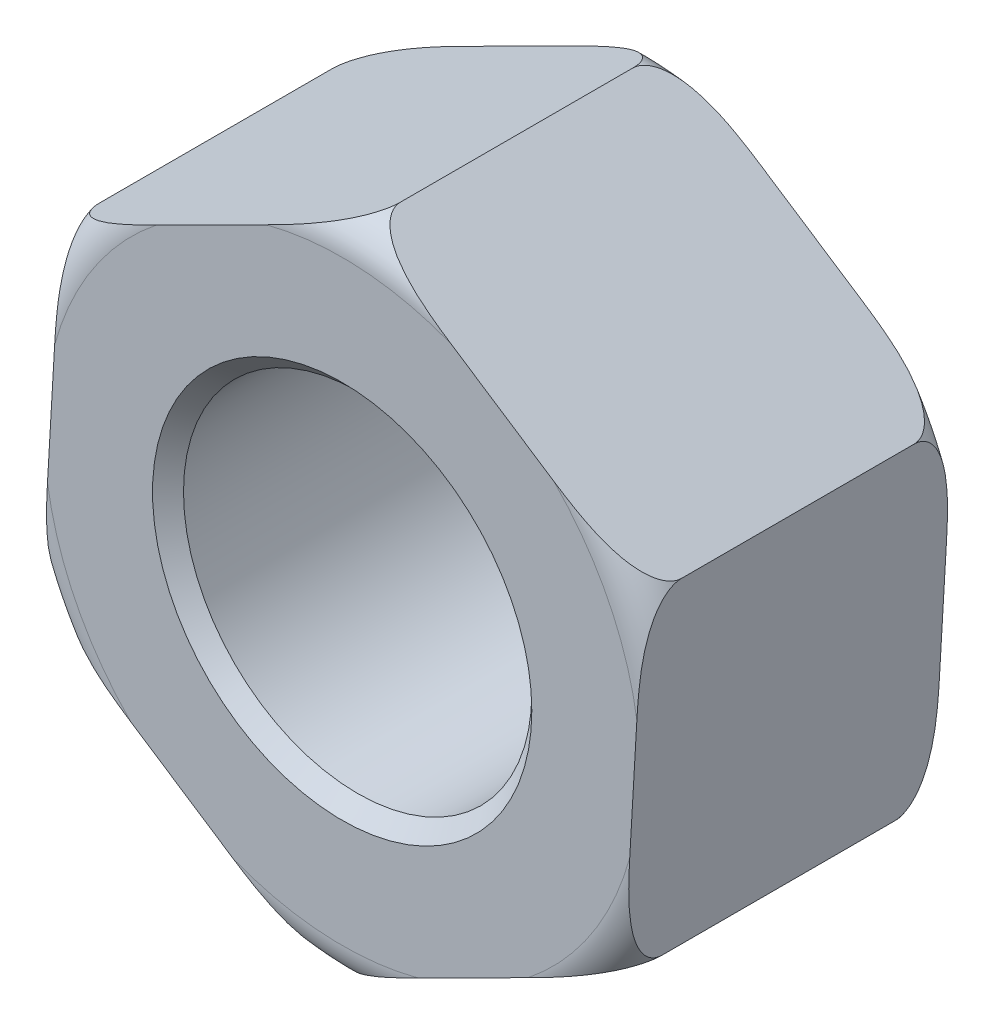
ISO-10303-21;
HEADER;
FILE_DESCRIPTION(('STEP AP214'),'2;1');
FILE_NAME('part.step','',(''),(''),'','','');
FILE_SCHEMA(('AUTOMOTIVE_DESIGN { 1 0 10303 214 1 1 1 1 }'));
ENDSEC;
DATA;
#1=APPLICATION_CONTEXT('core data for automotive mechanical design processes');
#2=APPLICATION_PROTOCOL_DEFINITION('international standard','automotive_design',2000,#1);
#3=PRODUCT_CONTEXT('',#1,'mechanical');
#4=PRODUCT('Part','Part','',(#3));
#5=PRODUCT_RELATED_PRODUCT_CATEGORY('part','',(#4));
#6=PRODUCT_DEFINITION_FORMATION('','',#4);
#7=PRODUCT_DEFINITION_CONTEXT('part definition',#1,'design');
#8=PRODUCT_DEFINITION('design','',#6,#7);
#9=PRODUCT_DEFINITION_SHAPE('','',#8);
#10=(LENGTH_UNIT() NAMED_UNIT(*) SI_UNIT(.MILLI.,.METRE.));
#11=(NAMED_UNIT(*) PLANE_ANGLE_UNIT() SI_UNIT($,.RADIAN.));
#12=(NAMED_UNIT(*) SI_UNIT($,.STERADIAN.) SOLID_ANGLE_UNIT());
#13=UNCERTAINTY_MEASURE_WITH_UNIT(LENGTH_MEASURE(1.E-05),#10,'distance_accuracy_value','');
#14=(GEOMETRIC_REPRESENTATION_CONTEXT(3) GLOBAL_UNCERTAINTY_ASSIGNED_CONTEXT((#13)) GLOBAL_UNIT_ASSIGNED_CONTEXT((#10,
#11,#12)) REPRESENTATION_CONTEXT('',''));
#15=CARTESIAN_POINT('',(0.,0.,0.));
#16=DIRECTION('',(0.,0.,1.));
#17=DIRECTION('',(1.,0.,0.));
#18=AXIS2_PLACEMENT_3D('',#15,#16,#17);
#19=CARTESIAN_POINT('',(0.,0.,4.));
#20=DIRECTION('',(0.,0.,1.));
#21=DIRECTION('',(1.,0.,0.));
#22=AXIS2_PLACEMENT_3D('',#19,#20,#21);
#23=PLANE('',#22);
#24=CARTESIAN_POINT('',(0.,0.,4.));
#25=DIRECTION('',(0.,0.,1.));
#26=DIRECTION('',(1.,0.,0.));
#27=AXIS2_PLACEMENT_3D('',#24,#25,#26);
#28=CIRCLE('',#27,2.45);
#29=CARTESIAN_POINT('',(2.45,0.,4.));
#30=VERTEX_POINT('',#29);
#31=EDGE_CURVE('E12',#30,#30,#28,.F.);
#32=ORIENTED_EDGE('',*,*,#31,.T.);
#33=EDGE_LOOP('',(#32));
#34=FACE_BOUND('',#33,.T.);
#35=CARTESIAN_POINT('',(0.,0.,4.));
#36=DIRECTION('',(0.,0.,1.));
#37=DIRECTION('',(1.,0.,0.));
#38=AXIS2_PLACEMENT_3D('',#35,#36,#37);
#39=CIRCLE('',#38,3.85);
#40=CARTESIAN_POINT('',(1.40628959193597,3.58397120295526,4.));
#41=VERTEX_POINT('',#40);
#42=CARTESIAN_POINT('',(-0.981433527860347,3.72280649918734,4.));
#43=VERTEX_POINT('',#42);
#44=EDGE_CURVE('E171',#41,#43,#39,.T.);
#45=ORIENTED_EDGE('',*,*,#44,.T.);
#46=DIRECTION('',(-0.893588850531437,-0.448886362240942,0.));
#47=VECTOR('',#46,1.);
#48=CARTESIAN_POINT('',(0.252506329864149,4.34266514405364,4.));
#49=LINE('',#48,#47);
#50=CARTESIAN_POINT('',(-2.40066531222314,3.00986811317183,4.));
#51=VERTEX_POINT('',#50);
#52=EDGE_CURVE('E159',#43,#51,#49,.T.);
#53=ORIENTED_EDGE('',*,*,#52,.T.);
#54=CARTESIAN_POINT('',(-3.71476176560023,1.01145688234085,4.));
#55=VERTEX_POINT('',#54);
#56=EDGE_CURVE('E165',#51,#55,#39,.T.);
#57=ORIENTED_EDGE('',*,*,#56,.T.);
#58=DIRECTION('',(-0.0580474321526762,-0.998313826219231,0.));
#59=VECTOR('',#58,1.);
#60=CARTESIAN_POINT('',(-3.6346051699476,2.39000946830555,4.));
#61=LINE('',#60,#59);
#62=CARTESIAN_POINT('',(-3.80695490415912,-0.574103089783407,4.));
#63=VERTEX_POINT('',#62);
#64=EDGE_CURVE('E148',#55,#63,#61,.T.);
#65=ORIENTED_EDGE('',*,*,#64,.T.);
#66=CARTESIAN_POINT('',(-2.73332823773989,-2.71134961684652,4.));
#67=VERTEX_POINT('',#66);
#68=EDGE_CURVE('E172',#63,#67,#39,.T.);
#69=ORIENTED_EDGE('',*,*,#68,.T.);
#70=DIRECTION('',(0.835541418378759,-0.549427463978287,0.));
#71=VECTOR('',#70,1.);
#72=CARTESIAN_POINT('',(-3.88711149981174,-1.95265567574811,4.));
#73=LINE('',#72,#71);
#74=CARTESIAN_POINT('',(-1.406289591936,-3.58397120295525,4.));
#75=VERTEX_POINT('',#74);
#76=EDGE_CURVE('E158',#67,#75,#73,.T.);
#77=ORIENTED_EDGE('',*,*,#76,.T.);
#78=CARTESIAN_POINT('',(0.981433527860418,-3.72280649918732,4.));
#79=VERTEX_POINT('',#78);
#80=EDGE_CURVE('E175',#75,#79,#39,.T.);
#81=ORIENTED_EDGE('',*,*,#80,.T.);
#82=DIRECTION('',(0.893588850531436,0.448886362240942,0.));
#83=VECTOR('',#82,1.);
#84=CARTESIAN_POINT('',(-0.252506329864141,-4.34266514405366,4.));
#85=LINE('',#84,#83);
#86=CARTESIAN_POINT('',(2.40066531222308,-3.00986811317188,4.));
#87=VERTEX_POINT('',#86);
#88=EDGE_CURVE('E376',#79,#87,#85,.T.);
#89=ORIENTED_EDGE('',*,*,#88,.T.);
#90=CARTESIAN_POINT('',(3.71476176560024,-1.01145688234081,4.));
#91=VERTEX_POINT('',#90);
#92=EDGE_CURVE('E178',#87,#91,#39,.T.);
#93=ORIENTED_EDGE('',*,*,#92,.T.);
#94=DIRECTION('',(0.0580474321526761,0.998313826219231,0.));
#95=VECTOR('',#94,1.);
#96=CARTESIAN_POINT('',(3.63460516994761,-2.39000946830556,4.));
#97=LINE('',#96,#95);
#98=CARTESIAN_POINT('',(3.80695490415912,0.574103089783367,4.));
#99=VERTEX_POINT('',#98);
#100=EDGE_CURVE('E373',#91,#99,#97,.T.);
#101=ORIENTED_EDGE('',*,*,#100,.T.);
#102=CARTESIAN_POINT('',(2.73332823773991,2.71134961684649,4.));
#103=VERTEX_POINT('',#102);
#104=EDGE_CURVE('E174',#99,#103,#39,.T.);
#105=ORIENTED_EDGE('',*,*,#104,.T.);
#106=DIRECTION('',(-0.835541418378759,0.549427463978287,0.));
#107=VECTOR('',#106,1.);
#108=CARTESIAN_POINT('',(3.88711149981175,1.95265567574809,4.));
#109=LINE('',#108,#107);
#110=EDGE_CURVE('E313',#103,#41,#109,.T.);
#111=ORIENTED_EDGE('',*,*,#110,.T.);
#112=EDGE_LOOP('',(#45,#53,#57,#65,#69,#77,#81,#89,#93,#101,#105,#111));
#113=FACE_BOUND('',#112,.T.);
#114=ADVANCED_FACE('F27',(#34,#113),#23,.T.);
#115=CARTESIAN_POINT('',(0.,0.,0.));
#116=DIRECTION('',(0.,0.,1.));
#117=DIRECTION('',(1.,0.,0.));
#118=AXIS2_PLACEMENT_3D('',#115,#116,#117);
#119=PLANE('',#118);
#120=CARTESIAN_POINT('',(0.,0.,0.));
#121=DIRECTION('',(0.,0.,1.));
#122=DIRECTION('',(1.,0.,0.));
#123=AXIS2_PLACEMENT_3D('',#120,#121,#122);
#124=CIRCLE('',#123,2.45);
#125=CARTESIAN_POINT('',(2.45,0.,0.));
#126=VERTEX_POINT('',#125);
#127=EDGE_CURVE('E282',#126,#126,#124,.T.);
#128=ORIENTED_EDGE('',*,*,#127,.T.);
#129=EDGE_LOOP('',(#128));
#130=FACE_BOUND('',#129,.T.);
#131=DIRECTION('',(-0.893588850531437,-0.448886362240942,0.));
#132=VECTOR('',#131,1.);
#133=CARTESIAN_POINT('',(0.252506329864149,4.34266514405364,0.));
#134=LINE('',#133,#132);
#135=CARTESIAN_POINT('',(-0.981433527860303,3.72280649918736,0.));
#136=VERTEX_POINT('',#135);
#137=CARTESIAN_POINT('',(-2.40066531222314,3.00986811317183,0.));
#138=VERTEX_POINT('',#137);
#139=EDGE_CURVE('E303',#136,#138,#134,.T.);
#140=ORIENTED_EDGE('',*,*,#139,.F.);
#141=CARTESIAN_POINT('',(0.,0.,0.));
#142=DIRECTION('',(0.,0.,1.));
#143=DIRECTION('',(1.,0.,0.));
#144=AXIS2_PLACEMENT_3D('',#141,#142,#143);
#145=CIRCLE('',#144,3.85);
#146=CARTESIAN_POINT('',(1.40628959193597,3.58397120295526,0.));
#147=VERTEX_POINT('',#146);
#148=EDGE_CURVE('E306',#136,#147,#145,.F.);
#149=ORIENTED_EDGE('',*,*,#148,.T.);
#150=DIRECTION('',(-0.835541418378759,0.549427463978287,0.));
#151=VECTOR('',#150,1.);
#152=CARTESIAN_POINT('',(3.88711149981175,1.95265567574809,0.));
#153=LINE('',#152,#151);
#154=CARTESIAN_POINT('',(2.73332823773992,2.71134961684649,0.));
#155=VERTEX_POINT('',#154);
#156=EDGE_CURVE('E364',#155,#147,#153,.T.);
#157=ORIENTED_EDGE('',*,*,#156,.F.);
#158=CARTESIAN_POINT('',(3.80695490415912,0.574103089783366,0.));
#159=VERTEX_POINT('',#158);
#160=EDGE_CURVE('E317',#155,#159,#145,.F.);
#161=ORIENTED_EDGE('',*,*,#160,.T.);
#162=DIRECTION('',(0.0580474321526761,0.998313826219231,0.));
#163=VECTOR('',#162,1.);
#164=CARTESIAN_POINT('',(3.63460516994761,-2.39000946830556,0.));
#165=LINE('',#164,#163);
#166=CARTESIAN_POINT('',(3.71476176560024,-1.01145688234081,0.));
#167=VERTEX_POINT('',#166);
#168=EDGE_CURVE('E353',#167,#159,#165,.T.);
#169=ORIENTED_EDGE('',*,*,#168,.F.);
#170=CARTESIAN_POINT('',(2.40066531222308,-3.00986811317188,0.));
#171=VERTEX_POINT('',#170);
#172=EDGE_CURVE('E179',#167,#171,#145,.F.);
#173=ORIENTED_EDGE('',*,*,#172,.T.);
#174=DIRECTION('',(0.893588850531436,0.448886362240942,0.));
#175=VECTOR('',#174,1.);
#176=CARTESIAN_POINT('',(-0.252506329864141,-4.34266514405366,0.));
#177=LINE('',#176,#175);
#178=CARTESIAN_POINT('',(0.981433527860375,-3.72280649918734,0.));
#179=VERTEX_POINT('',#178);
#180=EDGE_CURVE('E365',#179,#171,#177,.T.);
#181=ORIENTED_EDGE('',*,*,#180,.F.);
#182=CARTESIAN_POINT('',(-1.406289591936,-3.58397120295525,0.));
#183=VERTEX_POINT('',#182);
#184=EDGE_CURVE('E324',#179,#183,#145,.F.);
#185=ORIENTED_EDGE('',*,*,#184,.T.);
#186=DIRECTION('',(0.835541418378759,-0.549427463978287,0.));
#187=VECTOR('',#186,1.);
#188=CARTESIAN_POINT('',(-3.88711149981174,-1.95265567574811,0.));
#189=LINE('',#188,#187);
#190=CARTESIAN_POINT('',(-2.73332823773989,-2.71134961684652,0.));
#191=VERTEX_POINT('',#190);
#192=EDGE_CURVE('E333',#191,#183,#189,.T.);
#193=ORIENTED_EDGE('',*,*,#192,.F.);
#194=CARTESIAN_POINT('',(-3.80695490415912,-0.574103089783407,0.));
#195=VERTEX_POINT('',#194);
#196=EDGE_CURVE('E318',#191,#195,#145,.F.);
#197=ORIENTED_EDGE('',*,*,#196,.T.);
#198=DIRECTION('',(-0.0580474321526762,-0.998313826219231,0.));
#199=VECTOR('',#198,1.);
#200=CARTESIAN_POINT('',(-3.6346051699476,2.39000946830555,0.));
#201=LINE('',#200,#199);
#202=CARTESIAN_POINT('',(-3.71476176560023,1.01145688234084,0.));
#203=VERTEX_POINT('',#202);
#204=EDGE_CURVE('E312',#203,#195,#201,.T.);
#205=ORIENTED_EDGE('',*,*,#204,.F.);
#206=EDGE_CURVE('E309',#203,#138,#145,.F.);
#207=ORIENTED_EDGE('',*,*,#206,.T.);
#208=EDGE_LOOP('',(#140,#149,#157,#161,#169,#173,#181,#185,#193,#197,#205,#207));
#209=FACE_BOUND('',#208,.T.);
#210=ADVANCED_FACE('F226',(#130,#209),#119,.F.);
#211=CARTESIAN_POINT('',(0.,0.,0.5));
#212=DIRECTION('',(0.,0.,1.));
#213=DIRECTION('',(1.,0.,0.));
#214=AXIS2_PLACEMENT_3D('',#211,#212,#213);
#215=TOROIDAL_SURFACE('',#214,3.85,0.5);
#216=ORIENTED_EDGE('',*,*,#148,.F.);
#217=CARTESIAN_POINT('',(0.238553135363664,4.33565588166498,0.587896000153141));
#218=CARTESIAN_POINT('',(0.24309646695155,4.33793818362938,0.573855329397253));
#219=CARTESIAN_POINT('',(0.246582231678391,4.33968922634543,0.559366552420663));
#220=CARTESIAN_POINT('',(0.251277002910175,4.3420476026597,0.529985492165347));
#221=CARTESIAN_POINT('',(0.25249336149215,4.34265862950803,0.51509467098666));
#222=CARTESIAN_POINT('',(0.252519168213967,4.34267159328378,0.485290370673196));
#223=CARTESIAN_POINT('',(0.251326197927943,4.34207231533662,0.470376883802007));
#224=CARTESIAN_POINT('',(0.246652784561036,4.33972466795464,0.441020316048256));
#225=CARTESIAN_POINT('',(0.243172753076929,4.33797650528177,0.426577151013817));
#226=CARTESIAN_POINT('',(0.234241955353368,4.33349019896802,0.398594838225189));
#227=CARTESIAN_POINT('',(0.228804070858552,4.33075852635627,0.385050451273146));
#228=CARTESIAN_POINT('',(0.216301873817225,4.32447815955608,0.358939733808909));
#229=CARTESIAN_POINT('',(0.209236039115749,4.32092870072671,0.346374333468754));
#230=CARTESIAN_POINT('',(0.188623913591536,4.31057438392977,0.314183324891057));
#231=CARTESIAN_POINT('',(0.173914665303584,4.30318532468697,0.295491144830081));
#232=CARTESIAN_POINT('',(0.142105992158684,4.2872065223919,0.260864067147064));
#233=CARTESIAN_POINT('',(0.12499985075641,4.27861340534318,0.244937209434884));
#234=CARTESIAN_POINT('',(0.0759693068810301,4.25398335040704,0.204586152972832));
#235=CARTESIAN_POINT('',(0.0424537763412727,4.23714712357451,0.182605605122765));
#236=CARTESIAN_POINT('',(-0.0269627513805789,4.20227635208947,0.144169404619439));
#237=CARTESIAN_POINT('',(-0.0628691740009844,4.18423908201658,0.127726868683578));
#238=CARTESIAN_POINT('',(-0.14947114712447,4.14073535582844,0.0937486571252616));
#239=CARTESIAN_POINT('',(-0.200732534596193,4.11498465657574,0.0780506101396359));
#240=CARTESIAN_POINT('',(-0.304390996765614,4.06291275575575,0.0521936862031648));
#241=CARTESIAN_POINT('',(-0.356790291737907,4.03659043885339,0.0420468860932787));
#242=CARTESIAN_POINT('',(-0.462320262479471,3.98357840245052,0.0257318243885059));
#243=CARTESIAN_POINT('',(-0.515453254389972,3.95688751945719,0.0195831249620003));
#244=CARTESIAN_POINT('',(-0.62185462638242,3.9034377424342,0.0101848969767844));
#245=CARTESIAN_POINT('',(-0.67512282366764,3.87667894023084,0.00693254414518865));
#246=CARTESIAN_POINT('',(-0.780319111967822,3.82383452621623,0.00247556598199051));
#247=CARTESIAN_POINT('',(-0.832245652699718,3.79774969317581,0.00121939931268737));
#248=CARTESIAN_POINT('',(-0.936112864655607,3.74557292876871,-7.50803723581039E-05));
#249=CARTESIAN_POINT('',(-0.988053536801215,3.71948099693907,-0.000113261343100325));
#250=CARTESIAN_POINT('',(-1.14393989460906,3.64117288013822,0.000732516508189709));
#251=CARTESIAN_POINT('',(-1.24787763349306,3.58896068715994,0.00257818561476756));
#252=CARTESIAN_POINT('',(-1.45591115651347,3.4844569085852,0.00557514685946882));
#253=CARTESIAN_POINT('',(-1.56000695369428,3.43216531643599,0.00672544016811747));
#254=CARTESIAN_POINT('',(-1.76810404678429,3.32762960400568,0.00703738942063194));
#255=CARTESIAN_POINT('',(-1.87210533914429,3.27538548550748,0.00620092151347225));
#256=CARTESIAN_POINT('',(-2.08113977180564,3.17037890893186,0.00343903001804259));
#257=CARTESIAN_POINT('',(-2.18617276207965,3.11761652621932,0.00150273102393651));
#258=CARTESIAN_POINT('',(-2.34389353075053,3.03838690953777,6.80648950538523E-05));
#259=CARTESIAN_POINT('',(-2.39657347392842,3.01192361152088,-0.000164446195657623));
#260=CARTESIAN_POINT('',(-2.50192693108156,2.95900024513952,0.00043273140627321));
#261=CARTESIAN_POINT('',(-2.55460044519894,2.93254017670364,0.00126232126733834));
#262=CARTESIAN_POINT('',(-2.6593371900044,2.8799266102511,0.00462196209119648));
#263=CARTESIAN_POINT('',(-2.71140083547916,2.85377290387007,0.00713344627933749));
#264=CARTESIAN_POINT('',(-2.81538066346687,2.8015395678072,0.0146223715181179));
#265=CARTESIAN_POINT('',(-2.86729689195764,2.77545991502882,0.0195989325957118));
#266=CARTESIAN_POINT('',(-2.97053890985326,2.72359721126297,0.0329741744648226));
#267=CARTESIAN_POINT('',(-3.02186633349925,2.69781333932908,0.0413564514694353));
#268=CARTESIAN_POINT('',(-3.12371224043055,2.64665195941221,0.0628209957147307));
#269=CARTESIAN_POINT('',(-3.17423187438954,2.62127387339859,0.075895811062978));
#270=CARTESIAN_POINT('',(-3.24391880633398,2.58626726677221,0.0988382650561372));
#271=CARTESIAN_POINT('',(-3.26380866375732,2.57627577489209,0.105965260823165));
#272=CARTESIAN_POINT('',(-3.30321657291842,2.55647956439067,0.12146209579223));
#273=CARTESIAN_POINT('',(-3.32273438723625,2.54667496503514,0.12983270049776));
#274=CARTESIAN_POINT('',(-3.36119137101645,2.52735644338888,0.147984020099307));
#275=CARTESIAN_POINT('',(-3.38013177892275,2.51784189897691,0.157761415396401));
#276=CARTESIAN_POINT('',(-3.41725158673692,2.49919509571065,0.178965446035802));
#277=CARTESIAN_POINT('',(-3.43543157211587,2.49006254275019,0.190390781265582));
#278=CARTESIAN_POINT('',(-3.4712459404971,2.47207151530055,0.215532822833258));
#279=CARTESIAN_POINT('',(-3.48884855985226,2.46322899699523,0.22930702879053));
#280=CARTESIAN_POINT('',(-3.52239733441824,2.44637607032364,0.259238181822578));
#281=CARTESIAN_POINT('',(-3.53834362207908,2.43836559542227,0.275394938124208));
#282=CARTESIAN_POINT('',(-3.56490504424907,2.42502270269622,0.307007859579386));
#283=CARTESIAN_POINT('',(-3.57595556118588,2.41947157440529,0.322000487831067));
#284=CARTESIAN_POINT('',(-3.59578176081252,2.40951206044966,0.353762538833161));
#285=CARTESIAN_POINT('',(-3.60456257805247,2.40510109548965,0.370527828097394));
#286=CARTESIAN_POINT('',(-3.61745868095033,2.39862285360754,0.40167091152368));
#287=CARTESIAN_POINT('',(-3.62217982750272,2.396251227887,0.415732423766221));
#288=CARTESIAN_POINT('',(-3.6294684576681,2.39258984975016,0.444539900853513));
#289=CARTESIAN_POINT('',(-3.63203806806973,2.39129902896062,0.459285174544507));
#290=CARTESIAN_POINT('',(-3.63478688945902,2.38991818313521,0.489071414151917));
#291=CARTESIAN_POINT('',(-3.63496338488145,2.38982952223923,0.504112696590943));
#292=CARTESIAN_POINT('',(-3.63294240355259,2.39084474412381,0.534087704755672));
#293=CARTESIAN_POINT('',(-3.63073027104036,2.39195598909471,0.549020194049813));
#294=CARTESIAN_POINT('',(-3.62733469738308,2.39366172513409,0.563607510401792));
#295=B_SPLINE_CURVE_WITH_KNOTS('',3,(#217,#218,#219,#220,#221,#222,#223,#224,#225,#226,#227,
#228,#229,#230,#231,#232,#233,#234,#235,#236,#237,#238,#239,#240,#241,#242,#243,#244,#245,#246,
#247,#248,#249,#250,#251,#252,#253,#254,#255,#256,#257,#258,#259,#260,#261,#262,#263,#264,#265,
#266,#267,#268,#269,#270,#271,#272,#273,#274,#275,#276,#277,#278,#279,#280,#281,#282,#283,#284,
#285,#286,#287,#288,#289,#290,#291,#292,#293,#294),.UNSPECIFIED.,.F.,.F.,(4,2,2,2,2,2,2,2,2,2,2,
2,2,2,2,2,2,2,2,2,2,2,2,2,2,2,2,2,2,2,2,2,2,2,2,2,2,2,4),(0.,0.0447769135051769,
0.0894085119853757,0.134084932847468,0.17875331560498,0.223133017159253,0.267554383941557,
0.341842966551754,0.416344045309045,0.546025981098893,0.676012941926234,0.853990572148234,
1.03235387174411,1.21158343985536,1.3906380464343,1.5649896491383,1.73936015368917,
2.08834380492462,2.43782754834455,2.78698139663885,3.13964941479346,3.31650576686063,
3.49334566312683,3.66826487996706,3.84312169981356,4.01714611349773,4.1908953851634,
4.26098156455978,4.33111106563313,4.40107771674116,4.47098946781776,4.54295700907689,
4.61491879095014,4.6730319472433,4.73101246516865,4.77589439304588,4.82073190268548,
4.86562028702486,4.91078566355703),.UNSPECIFIED.);
#296=CARTESIAN_POINT('',(0.252506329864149,4.34266514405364,0.5));
#297=VERTEX_POINT('',#296);
#298=EDGE_CURVE('E254',#136,#297,#295,.F.);
#299=ORIENTED_EDGE('',*,*,#298,.T.);
#300=CARTESIAN_POINT('',(0.252506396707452,4.34266510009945,0.500199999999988));
#301=CARTESIAN_POINT('',(0.252466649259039,4.34269123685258,0.485202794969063));
#302=CARTESIAN_POINT('',(0.253612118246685,4.34193801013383,0.470242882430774));
#303=CARTESIAN_POINT('',(0.258014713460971,4.33904299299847,0.440902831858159));
#304=CARTESIAN_POINT('',(0.261253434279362,4.33691330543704,0.426518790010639));
#305=CARTESIAN_POINT('',(0.269579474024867,4.33143834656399,0.398602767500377));
#306=CARTESIAN_POINT('',(0.274661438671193,4.32809659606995,0.385068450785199));
#307=CARTESIAN_POINT('',(0.286350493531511,4.32041021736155,0.358957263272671));
#308=CARTESIAN_POINT('',(0.292961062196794,4.31606330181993,0.346382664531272));
#309=CARTESIAN_POINT('',(0.312239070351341,4.30338665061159,0.314182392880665));
#310=CARTESIAN_POINT('',(0.325993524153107,4.29434212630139,0.295489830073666));
#311=CARTESIAN_POINT('',(0.355736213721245,4.27478420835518,0.260863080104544));
#312=CARTESIAN_POINT('',(0.371730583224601,4.26426678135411,0.24493674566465));
#313=CARTESIAN_POINT('',(0.417577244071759,4.23411936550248,0.204584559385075));
#314=CARTESIAN_POINT('',(0.448917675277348,4.21351081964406,0.182602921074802));
#315=CARTESIAN_POINT('',(0.513825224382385,4.17082952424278,0.144167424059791));
#316=CARTESIAN_POINT('',(0.547397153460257,4.14875361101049,0.127726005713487));
#317=CARTESIAN_POINT('',(0.628360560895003,4.09551445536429,0.0937531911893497));
#318=CARTESIAN_POINT('',(0.676280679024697,4.06400359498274,0.0780578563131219));
#319=CARTESIAN_POINT('',(0.773182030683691,4.00028411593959,0.0522045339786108));
#320=CARTESIAN_POINT('',(0.82216532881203,3.96807413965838,0.0420585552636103));
#321=CARTESIAN_POINT('',(0.920804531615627,3.90321190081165,0.0257451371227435));
#322=CARTESIAN_POINT('',(0.970462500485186,3.87055828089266,0.0195963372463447));
#323=CARTESIAN_POINT('',(1.06997522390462,3.80512164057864,0.0101915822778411));
#324=CARTESIAN_POINT('',(1.11983005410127,3.77233857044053,0.00693687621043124));
#325=CARTESIAN_POINT('',(1.244365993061,3.69044739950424,0.00128842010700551));
#326=CARTESIAN_POINT('',(1.31908153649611,3.64131665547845,0.000124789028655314));
#327=CARTESIAN_POINT('',(1.46852850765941,3.54304472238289,-0.000105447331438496));
#328=CARTESIAN_POINT('',(1.54325992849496,3.49390353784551,0.000828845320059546));
#329=CARTESIAN_POINT('',(1.69245161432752,3.39579947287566,0.00307804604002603));
#330=CARTESIAN_POINT('',(1.76691189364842,3.34683658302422,0.00439158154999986));
#331=CARTESIAN_POINT('',(1.91582610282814,3.24891497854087,0.00628886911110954));
#332=CARTESIAN_POINT('',(1.9902800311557,3.19995626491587,0.00687276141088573));
#333=CARTESIAN_POINT('',(2.11499594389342,3.11794674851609,0.00691991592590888));
#334=CARTESIAN_POINT('',(2.1652578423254,3.08489600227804,0.00668565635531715));
#335=CARTESIAN_POINT('',(2.26577904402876,3.01879621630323,0.00579704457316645));
#336=CARTESIAN_POINT('',(2.3160383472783,2.98574717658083,0.00514268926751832));
#337=CARTESIAN_POINT('',(2.41657881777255,2.91963472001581,0.00363773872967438));
#338=CARTESIAN_POINT('',(2.46685998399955,2.88657130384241,0.0027870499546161));
#339=CARTESIAN_POINT('',(2.56742275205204,2.82044418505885,0.00125974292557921));
#340=CARTESIAN_POINT('',(2.61770435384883,2.78738048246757,0.000583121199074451));
#341=CARTESIAN_POINT('',(2.73510763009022,2.71017954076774,-0.000226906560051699));
#342=CARTESIAN_POINT('',(2.80223224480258,2.66604036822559,-0.000102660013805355));
#343=CARTESIAN_POINT('',(2.93653168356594,2.57772900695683,0.00282275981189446));
#344=CARTESIAN_POINT('',(3.00370646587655,2.53355684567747,0.00562727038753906));
#345=CARTESIAN_POINT('',(3.14258010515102,2.44223762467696,0.0162266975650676));
#346=CARTESIAN_POINT('',(3.2142658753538,2.39509917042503,0.0243577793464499));
#347=CARTESIAN_POINT('',(3.32091046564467,2.32497282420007,0.043075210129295));
#348=CARTESIAN_POINT('',(3.35626321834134,2.30172589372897,0.0503866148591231));
#349=CARTESIAN_POINT('',(3.42650816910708,2.25553487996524,0.0677866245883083));
#350=CARTESIAN_POINT('',(3.46140034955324,2.23259080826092,0.0778753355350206));
#351=CARTESIAN_POINT('',(3.52195198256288,2.19277383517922,0.0987114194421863));
#352=CARTESIAN_POINT('',(3.54779163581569,2.17578243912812,0.108700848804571));
#353=CARTESIAN_POINT('',(3.59869971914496,2.14230678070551,0.131146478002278));
#354=CARTESIAN_POINT('',(3.62376889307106,2.12582202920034,0.143600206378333));
#355=CARTESIAN_POINT('',(3.67293325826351,2.09349298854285,0.171661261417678));
#356=CARTESIAN_POINT('',(3.69701803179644,2.07765554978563,0.187295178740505));
#357=CARTESIAN_POINT('',(3.74317225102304,2.04730589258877,0.22236944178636));
#358=CARTESIAN_POINT('',(3.76524689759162,2.03279025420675,0.241799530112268));
#359=CARTESIAN_POINT('',(3.79715814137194,2.01180635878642,0.275861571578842));
#360=CARTESIAN_POINT('',(3.80815547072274,2.00457483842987,0.28892890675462));
#361=CARTESIAN_POINT('',(3.82865360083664,1.99109587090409,0.316688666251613));
#362=CARTESIAN_POINT('',(3.83815376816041,1.98484884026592,0.331381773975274));
#363=CARTESIAN_POINT('',(3.85522213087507,1.97362518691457,0.362600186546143));
#364=CARTESIAN_POINT('',(3.86276360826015,1.96866613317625,0.379146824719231));
#365=CARTESIAN_POINT('',(3.87505502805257,1.96058365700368,0.413646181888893));
#366=CARTESIAN_POINT('',(3.87981553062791,1.95745329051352,0.431593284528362));
#367=CARTESIAN_POINT('',(3.88430023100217,1.95450428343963,0.458186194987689));
#368=CARTESIAN_POINT('',(3.88535452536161,1.95381101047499,0.4665283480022));
#369=CARTESIAN_POINT('',(3.8867644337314,1.95288389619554,0.483311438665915));
#370=CARTESIAN_POINT('',(3.88711880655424,1.95265087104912,0.49175252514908));
#371=CARTESIAN_POINT('',(3.88711143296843,1.95265571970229,0.500199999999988));
#372=B_SPLINE_CURVE_WITH_KNOTS('',3,(#300,#301,#302,#303,#304,#305,#306,#307,#308,#309,#310,
#311,#312,#313,#314,#315,#316,#317,#318,#319,#320,#321,#322,#323,#324,#325,#326,#327,#328,#329,
#330,#331,#332,#333,#334,#335,#336,#337,#338,#339,#340,#341,#342,#343,#344,#345,#346,#347,#348,
#349,#350,#351,#352,#353,#354,#355,#356,#357,#358,#359,#360,#361,#362,#363,#364,#365,#366,#367,
#368,#369,#370,#371),.UNSPECIFIED.,.F.,.F.,(4,2,2,2,2,2,2,2,2,2,2,2,2,2,2,2,2,2,2,2,2,2,2,2,2,2,
2,2,2,2,2,2,2,2,2,4),(0.,0.0448669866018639,0.0893447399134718,0.133694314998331,
0.178145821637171,0.252436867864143,0.326935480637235,0.456625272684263,0.586604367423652,
0.764540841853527,0.942860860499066,1.12200656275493,1.30122954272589,1.56945115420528,
1.83778758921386,2.10516477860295,2.37249056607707,2.55295456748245,2.73341989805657,
2.91397138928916,3.09451927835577,3.33550385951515,3.57678889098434,3.83499425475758,
3.96374266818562,4.09249599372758,4.18991228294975,4.28723136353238,4.38540033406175,
4.48330762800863,4.5388269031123,4.5943696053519,4.65063428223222,4.7066838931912,
4.73195800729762,4.75727690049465),.UNSPECIFIED.);
#373=EDGE_CURVE('E252',#297,#147,#372,.T.);
#374=ORIENTED_EDGE('',*,*,#373,.T.);
#375=EDGE_LOOP('',(#216,#299,#374));
#376=FACE_BOUND('',#375,.T.);
#377=ADVANCED_FACE('F221',(#376),#215,.T.);
#378=ORIENTED_EDGE('',*,*,#160,.F.);
#379=CARTESIAN_POINT('',(3.88711149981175,1.95265567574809,0.5));
#380=VERTEX_POINT('',#379);
#381=EDGE_CURVE('E246',#155,#380,#372,.T.);
#382=ORIENTED_EDGE('',*,*,#381,.T.);
#383=CARTESIAN_POINT('',(3.88711149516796,1.95265559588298,0.5002));
#384=CARTESIAN_POINT('',(3.88711425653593,1.95270308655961,0.485202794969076));
#385=CARTESIAN_POINT('',(3.8870346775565,1.95133446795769,0.470242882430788));
#386=CARTESIAN_POINT('',(3.88672881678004,1.94607420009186,0.440902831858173));
#387=CARTESIAN_POINT('',(3.88650381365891,1.94220454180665,0.426518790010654));
#388=CARTESIAN_POINT('',(3.88592538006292,1.9322565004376,0.398602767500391));
#389=CARTESIAN_POINT('',(3.88557232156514,1.92618451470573,0.385068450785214));
#390=CARTESIAN_POINT('',(3.88476024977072,1.91221830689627,0.358957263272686));
#391=CARTESIAN_POINT('',(3.88430099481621,1.90431992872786,0.346382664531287));
#392=CARTESIAN_POINT('',(3.88296169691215,1.88128635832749,0.314182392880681));
#393=CARTESIAN_POINT('',(3.88200613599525,1.86485238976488,0.295489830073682));
#394=CARTESIAN_POINT('',(3.87993982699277,1.8293155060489,0.260863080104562));
#395=CARTESIAN_POINT('',(3.87882865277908,1.81020526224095,0.244936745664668));
#396=CARTESIAN_POINT('',(3.87564355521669,1.75542718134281,0.204584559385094));
#397=CARTESIAN_POINT('',(3.87346624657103,1.717981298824,0.182602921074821));
#398=CARTESIAN_POINT('',(3.86895693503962,1.64042906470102,0.14416742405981));
#399=CARTESIAN_POINT('',(3.86662459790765,1.6003169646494,0.127726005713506));
#400=CARTESIAN_POINT('',(3.86099984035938,1.50358101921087,0.0937531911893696));
#401=CARTESIAN_POINT('',(3.8576706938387,1.44632554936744,0.0780578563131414));
#402=CARTESIAN_POINT('',(3.85093868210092,1.33054677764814,0.0522045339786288));
#403=CARTESIAN_POINT('',(3.84753567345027,1.27202100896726,0.0420585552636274));
#404=CARTESIAN_POINT('',(3.84068292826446,1.15416583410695,0.0257451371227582));
#405=CARTESIAN_POINT('',(3.83723304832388,1.09483396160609,0.019596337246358));
#406=CARTESIAN_POINT('',(3.83031961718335,0.975935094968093,0.0101915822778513));
#407=CARTESIAN_POINT('',(3.82685606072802,0.916368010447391,0.0069368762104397));
#408=CARTESIAN_POINT('',(3.81820419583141,0.767571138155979,0.00128842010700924));
#409=CARTESIAN_POINT('',(3.8130134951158,0.678300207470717,0.000124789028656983));
#410=CARTESIAN_POINT('',(3.80263099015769,0.49973936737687,-0.000105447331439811));
#411=CARTESIAN_POINT('',(3.79743918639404,0.410449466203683,0.000828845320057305));
#412=CARTESIAN_POINT('',(3.78707441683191,0.232193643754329,0.00307804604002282));
#413=CARTESIAN_POINT('',(3.78190145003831,0.143227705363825,0.00439158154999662));
#414=CARTESIAN_POINT('',(3.77155595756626,-0.0346965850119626,0.00628886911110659));
#415=CARTESIAN_POINT('',(3.76638343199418,-0.12365493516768,0.00687276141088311));
#416=CARTESIAN_POINT('',(3.75771906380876,-0.272666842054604,0.00691991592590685));
#417=CARTESIAN_POINT('',(3.75422722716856,-0.332720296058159,0.00668565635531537));
#418=CARTESIAN_POINT('',(3.74724373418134,-0.452824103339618,0.0057970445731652));
#419=CARTESIAN_POINT('',(3.74375207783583,-0.512874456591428,0.00514268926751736));
#420=CARTESIAN_POINT('',(3.73676724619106,-0.633001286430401,0.00363773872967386));
#421=CARTESIAN_POINT('',(3.73327407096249,-0.693077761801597,0.00278704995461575));
#422=CARTESIAN_POINT('',(3.7262876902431,-0.813231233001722,0.0012597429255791));
#423=CARTESIAN_POINT('',(3.72279448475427,-0.873308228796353,0.000583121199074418));
#424=CARTESIAN_POINT('',(3.71463814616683,-1.01358291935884,-0.000226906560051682));
#425=CARTESIAN_POINT('',(3.70997480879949,-1.09378412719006,-0.000102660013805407));
#426=CARTESIAN_POINT('',(3.70064464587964,-1.25424653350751,0.00282275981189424));
#427=CARTESIAN_POINT('',(3.69597782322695,-1.33450768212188,0.00562727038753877));
#428=CARTESIAN_POINT('',(3.68632987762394,-1.50043539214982,0.0162266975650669));
#429=CARTESIAN_POINT('',(3.68134966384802,-1.58608631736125,0.0243577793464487));
#430=CARTESIAN_POINT('',(3.67394076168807,-1.71350641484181,0.0430752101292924));
#431=CARTESIAN_POINT('',(3.67148470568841,-1.75574626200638,0.05038661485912));
#432=CARTESIAN_POINT('',(3.66660458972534,-1.83967568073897,0.0677866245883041));
#433=CARTESIAN_POINT('',(3.66418053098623,-1.88136523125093,0.0778753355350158));
#434=CARTESIAN_POINT('',(3.6599738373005,-1.95371297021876,0.0987114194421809));
#435=CARTESIAN_POINT('',(3.65817868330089,-1.98458646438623,0.108700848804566));
#436=CARTESIAN_POINT('',(3.65464195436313,-2.04541198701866,0.131146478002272));
#437=CARTESIAN_POINT('',(3.65290032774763,-2.07536490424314,0.143600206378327));
#438=CARTESIAN_POINT('',(3.64948473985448,-2.13410701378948,0.171661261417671));
#439=CARTESIAN_POINT('',(3.64781150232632,-2.16288375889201,0.187295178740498));
#440=CARTESIAN_POINT('',(3.64460503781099,-2.21802931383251,0.222369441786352));
#441=CARTESIAN_POINT('',(3.6430714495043,-2.24440433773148,0.241799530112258));
#442=CARTESIAN_POINT('',(3.6408544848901,-2.28253223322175,0.275861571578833));
#443=CARTESIAN_POINT('',(3.64009046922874,-2.29567195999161,0.28892890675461));
#444=CARTESIAN_POINT('',(3.63866640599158,-2.32016334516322,0.316688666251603));
#445=CARTESIAN_POINT('',(3.63800640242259,-2.33151424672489,0.331381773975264));
#446=CARTESIAN_POINT('',(3.63682061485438,-2.35190770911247,0.362600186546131));
#447=CARTESIAN_POINT('',(3.6362966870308,-2.36091834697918,0.379146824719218));
#448=CARTESIAN_POINT('',(3.63544276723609,-2.37560426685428,0.413646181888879));
#449=CARTESIAN_POINT('',(3.63511204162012,-2.38129216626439,0.431593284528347));
#450=CARTESIAN_POINT('',(3.63480047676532,-2.3866505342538,0.458186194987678));
#451=CARTESIAN_POINT('',(3.63472723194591,-2.38791021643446,0.466528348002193));
#452=CARTESIAN_POINT('',(3.63462928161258,-2.38959479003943,0.483311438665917));
#453=CARTESIAN_POINT('',(3.63460466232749,-2.39001819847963,0.491752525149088));
#454=CARTESIAN_POINT('',(3.63460517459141,-2.39000938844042,0.5002));
#455=B_SPLINE_CURVE_WITH_KNOTS('',3,(#383,#384,#385,#386,#387,#388,#389,#390,#391,#392,#393,
#394,#395,#396,#397,#398,#399,#400,#401,#402,#403,#404,#405,#406,#407,#408,#409,#410,#411,#412,
#413,#414,#415,#416,#417,#418,#419,#420,#421,#422,#423,#424,#425,#426,#427,#428,#429,#430,#431,
#432,#433,#434,#435,#436,#437,#438,#439,#440,#441,#442,#443,#444,#445,#446,#447,#448,#449,#450,
#451,#452,#453,#454),.UNSPECIFIED.,.F.,.F.,(4,2,2,2,2,2,2,2,2,2,2,2,2,2,2,2,2,2,2,2,2,2,2,2,2,2,
2,2,2,2,2,2,2,2,2,4),(0.,0.0448669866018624,0.0893447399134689,0.133694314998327,
0.178145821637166,0.252436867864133,0.326935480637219,0.456625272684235,0.586604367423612,
0.76454084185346,0.942860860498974,1.12200656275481,1.30122954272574,1.56945115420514,
1.83778758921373,2.10516477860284,2.37249056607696,2.55295456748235,2.73341989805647,
2.91397138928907,3.09451927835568,3.33550385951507,3.57678889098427,3.83499425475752,
3.96374266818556,4.09249599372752,4.18991228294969,4.28723136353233,4.3854003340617,
4.48330762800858,4.53882690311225,4.59436960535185,4.65063428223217,4.70668389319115,
4.73195800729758,4.75727690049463),.UNSPECIFIED.);
#456=EDGE_CURVE('E253',#380,#159,#455,.T.);
#457=ORIENTED_EDGE('',*,*,#456,.T.);
#458=EDGE_LOOP('',(#378,#382,#457));
#459=FACE_BOUND('',#458,.T.);
#460=ADVANCED_FACE('F225',(#459),#215,.T.);
#461=ORIENTED_EDGE('',*,*,#172,.F.);
#462=CARTESIAN_POINT('',(3.63460516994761,-2.39000946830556,0.500000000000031));
#463=VERTEX_POINT('',#462);
#464=EDGE_CURVE('E240',#167,#463,#455,.T.);
#465=ORIENTED_EDGE('',*,*,#464,.T.);
#466=CARTESIAN_POINT('',(-0.238553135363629,-4.33565588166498,0.587896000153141));
#467=CARTESIAN_POINT('',(-0.243096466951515,-4.33793818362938,0.573855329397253));
#468=CARTESIAN_POINT('',(-0.246582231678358,-4.33968922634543,0.559366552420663));
#469=CARTESIAN_POINT('',(-0.251277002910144,-4.3420476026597,0.529985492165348));
#470=CARTESIAN_POINT('',(-0.25249336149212,-4.34265862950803,0.51509467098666));
#471=CARTESIAN_POINT('',(-0.252519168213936,-4.34267159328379,0.485290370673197));
#472=CARTESIAN_POINT('',(-0.251326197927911,-4.34207231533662,0.470376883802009));
#473=CARTESIAN_POINT('',(-0.246652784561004,-4.33972466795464,0.441020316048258));
#474=CARTESIAN_POINT('',(-0.243172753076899,-4.33797650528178,0.426577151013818));
#475=CARTESIAN_POINT('',(-0.234241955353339,-4.33349019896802,0.398594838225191));
#476=CARTESIAN_POINT('',(-0.228804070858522,-4.33075852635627,0.385050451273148));
#477=CARTESIAN_POINT('',(-0.216301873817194,-4.32447815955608,0.358939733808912));
#478=CARTESIAN_POINT('',(-0.209236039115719,-4.32092870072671,0.346374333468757));
#479=CARTESIAN_POINT('',(-0.188623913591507,-4.31057438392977,0.314183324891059));
#480=CARTESIAN_POINT('',(-0.173914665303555,-4.30318532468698,0.295491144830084));
#481=CARTESIAN_POINT('',(-0.142105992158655,-4.2872065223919,0.260864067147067));
#482=CARTESIAN_POINT('',(-0.12499985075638,-4.27861340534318,0.244937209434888));
#483=CARTESIAN_POINT('',(-0.0759693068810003,-4.25398335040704,0.204586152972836));
#484=CARTESIAN_POINT('',(-0.0424537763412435,-4.23714712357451,0.182605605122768));
#485=CARTESIAN_POINT('',(0.0269627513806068,-4.20227635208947,0.144169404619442));
#486=CARTESIAN_POINT('',(0.0628691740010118,-4.18423908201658,0.127726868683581));
#487=CARTESIAN_POINT('',(0.149471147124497,-4.14073535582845,0.093748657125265));
#488=CARTESIAN_POINT('',(0.20073253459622,-4.11498465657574,0.0780506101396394));
#489=CARTESIAN_POINT('',(0.304390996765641,-4.06291275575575,0.052193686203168));
#490=CARTESIAN_POINT('',(0.356790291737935,-4.03659043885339,0.0420468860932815));
#491=CARTESIAN_POINT('',(0.462320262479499,-3.98357840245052,0.025731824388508));
#492=CARTESIAN_POINT('',(0.51545325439,-3.95688751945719,0.0195831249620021));
#493=CARTESIAN_POINT('',(0.621854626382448,-3.9034377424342,0.0101848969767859));
#494=CARTESIAN_POINT('',(0.675122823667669,-3.87667894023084,0.00693254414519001));
#495=CARTESIAN_POINT('',(0.780319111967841,-3.82383452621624,0.00247556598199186));
#496=CARTESIAN_POINT('',(0.832245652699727,-3.79774969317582,0.00121939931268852));
#497=CARTESIAN_POINT('',(0.936112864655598,-3.74557292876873,-7.50803723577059E-05));
#498=CARTESIAN_POINT('',(0.988053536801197,-3.7194809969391,-0.000113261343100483));
#499=CARTESIAN_POINT('',(1.14393989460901,-3.64117288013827,0.000732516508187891));
#500=CARTESIAN_POINT('',(1.24787763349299,-3.58896068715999,0.00257818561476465));
#501=CARTESIAN_POINT('',(1.45591115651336,-3.48445690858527,0.00557514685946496));
#502=CARTESIAN_POINT('',(1.56000695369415,-3.43216531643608,0.00672544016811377));
#503=CARTESIAN_POINT('',(1.76810404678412,-3.32762960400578,0.00703738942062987));
#504=CARTESIAN_POINT('',(1.8721053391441,-3.27538548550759,0.00620092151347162));
#505=CARTESIAN_POINT('',(2.08113977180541,-3.17037890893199,0.00343903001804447));
#506=CARTESIAN_POINT('',(2.18617276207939,-3.11761652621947,0.00150273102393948));
#507=CARTESIAN_POINT('',(2.34389353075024,-3.03838690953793,6.80648950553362E-05));
#508=CARTESIAN_POINT('',(2.39657347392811,-3.01192361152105,-0.000164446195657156));
#509=CARTESIAN_POINT('',(2.50192693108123,-2.9590002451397,0.000432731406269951));
#510=CARTESIAN_POINT('',(2.5546004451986,-2.93254017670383,0.00126232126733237));
#511=CARTESIAN_POINT('',(2.65933719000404,-2.8799266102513,0.00462196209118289));
#512=CARTESIAN_POINT('',(2.71140083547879,-2.85377290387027,0.00713344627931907));
#513=CARTESIAN_POINT('',(2.81538066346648,-2.80153956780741,0.014622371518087));
#514=CARTESIAN_POINT('',(2.86729689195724,-2.77545991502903,0.0195989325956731));
#515=CARTESIAN_POINT('',(2.97053890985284,-2.72359721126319,0.032974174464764));
#516=CARTESIAN_POINT('',(3.02186633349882,-2.69781333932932,0.0413564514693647));
#517=CARTESIAN_POINT('',(3.12371224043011,-2.64665195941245,0.0628209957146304));
#518=CARTESIAN_POINT('',(3.1742318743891,-2.62127387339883,0.0758958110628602));
#519=CARTESIAN_POINT('',(3.24391880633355,-2.58626726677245,0.0988382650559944));
#520=CARTESIAN_POINT('',(3.2638086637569,-2.57627577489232,0.105965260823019));
#521=CARTESIAN_POINT('',(3.30321657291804,-2.55647956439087,0.12146209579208));
#522=CARTESIAN_POINT('',(3.32273438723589,-2.54667496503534,0.129832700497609));
#523=CARTESIAN_POINT('',(3.36119137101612,-2.52735644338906,0.147984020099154));
#524=CARTESIAN_POINT('',(3.38013177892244,-2.51784189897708,0.157761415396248));
#525=CARTESIAN_POINT('',(3.41725158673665,-2.4991950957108,0.178965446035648));
#526=CARTESIAN_POINT('',(3.43543157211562,-2.49006254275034,0.190390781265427));
#527=CARTESIAN_POINT('',(3.47124594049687,-2.47207151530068,0.215532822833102));
#528=CARTESIAN_POINT('',(3.48884855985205,-2.46322899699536,0.229307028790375));
#529=CARTESIAN_POINT('',(3.52239733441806,-2.44637607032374,0.259238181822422));
#530=CARTESIAN_POINT('',(3.53834362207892,-2.43836559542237,0.275394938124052));
#531=CARTESIAN_POINT('',(3.56490504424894,-2.42502270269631,0.307007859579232));
#532=CARTESIAN_POINT('',(3.57595556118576,-2.41947157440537,0.322000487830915));
#533=CARTESIAN_POINT('',(3.59578176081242,-2.40951206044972,0.353762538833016));
#534=CARTESIAN_POINT('',(3.60456257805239,-2.40510109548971,0.370527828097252));
#535=CARTESIAN_POINT('',(3.61745868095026,-2.39862285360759,0.401670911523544));
#536=CARTESIAN_POINT('',(3.62217982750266,-2.39625122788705,0.415732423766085));
#537=CARTESIAN_POINT('',(3.62946845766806,-2.3925898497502,0.444539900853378));
#538=CARTESIAN_POINT('',(3.63203806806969,-2.39129902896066,0.459285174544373));
#539=CARTESIAN_POINT('',(3.634786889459,-2.38991818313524,0.489071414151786));
#540=CARTESIAN_POINT('',(3.63496338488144,-2.38982952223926,0.504112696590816));
#541=CARTESIAN_POINT('',(3.63294240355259,-2.39084474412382,0.534087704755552));
#542=CARTESIAN_POINT('',(3.63073027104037,-2.39195598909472,0.549020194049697));
#543=CARTESIAN_POINT('',(3.62733469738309,-2.3936617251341,0.563607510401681));
#544=B_SPLINE_CURVE_WITH_KNOTS('',3,(#466,#467,#468,#469,#470,#471,#472,#473,#474,#475,#476,
#477,#478,#479,#480,#481,#482,#483,#484,#485,#486,#487,#488,#489,#490,#491,#492,#493,#494,#495,
#496,#497,#498,#499,#500,#501,#502,#503,#504,#505,#506,#507,#508,#509,#510,#511,#512,#513,#514,
#515,#516,#517,#518,#519,#520,#521,#522,#523,#524,#525,#526,#527,#528,#529,#530,#531,#532,#533,
#534,#535,#536,#537,#538,#539,#540,#541,#542,#543),.UNSPECIFIED.,.F.,.F.,(4,2,2,2,2,2,2,2,2,2,2,
2,2,2,2,2,2,2,2,2,2,2,2,2,2,2,2,2,2,2,2,2,2,2,2,2,2,2,4),(0.,0.0447769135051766,
0.0894085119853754,0.134084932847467,0.178753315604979,0.223133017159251,0.267554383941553,
0.341842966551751,0.416344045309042,0.546025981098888,0.676012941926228,0.853990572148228,
1.03235387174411,1.21158343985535,1.39063804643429,1.56498964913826,1.73936015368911,
2.08834380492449,2.43782754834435,2.78698139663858,3.13964941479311,3.31650576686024,
3.4933456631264,3.6682648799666,3.84312169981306,4.0171461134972,4.19089538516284,
4.26098156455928,4.33111106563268,4.40107771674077,4.47098946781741,4.54295700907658,
4.61491879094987,4.67303194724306,4.73101246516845,4.77589439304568,4.82073190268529,
4.86562028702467,4.91078566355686),.UNSPECIFIED.);
#545=EDGE_CURVE('E342',#463,#171,#544,.F.);
#546=ORIENTED_EDGE('',*,*,#545,.T.);
#547=EDGE_LOOP('',(#461,#465,#546));
#548=FACE_BOUND('',#547,.T.);
#549=ADVANCED_FACE('F447',(#548),#215,.T.);
#550=ORIENTED_EDGE('',*,*,#184,.F.);
#551=CARTESIAN_POINT('',(-0.252506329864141,-4.34266514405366,0.5));
#552=VERTEX_POINT('',#551);
#553=EDGE_CURVE('E235',#179,#552,#544,.F.);
#554=ORIENTED_EDGE('',*,*,#553,.T.);
#555=CARTESIAN_POINT('',(-0.252506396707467,-4.34266510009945,0.500199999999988));
#556=CARTESIAN_POINT('',(-0.252466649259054,-4.34269123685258,0.485202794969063));
#557=CARTESIAN_POINT('',(-0.2536121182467,-4.34193801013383,0.470242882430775));
#558=CARTESIAN_POINT('',(-0.258014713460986,-4.33904299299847,0.440902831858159));
#559=CARTESIAN_POINT('',(-0.261253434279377,-4.33691330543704,0.42651879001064));
#560=CARTESIAN_POINT('',(-0.269579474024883,-4.33143834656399,0.398602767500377));
#561=CARTESIAN_POINT('',(-0.274661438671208,-4.32809659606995,0.385068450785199));
#562=CARTESIAN_POINT('',(-0.286350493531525,-4.32041021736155,0.358957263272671));
#563=CARTESIAN_POINT('',(-0.292961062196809,-4.31606330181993,0.346382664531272));
#564=CARTESIAN_POINT('',(-0.312239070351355,-4.30338665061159,0.314182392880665));
#565=CARTESIAN_POINT('',(-0.325993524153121,-4.29434212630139,0.295489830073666));
#566=CARTESIAN_POINT('',(-0.35573621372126,-4.27478420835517,0.260863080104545));
#567=CARTESIAN_POINT('',(-0.371730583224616,-4.26426678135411,0.244936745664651));
#568=CARTESIAN_POINT('',(-0.417577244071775,-4.23411936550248,0.204584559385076));
#569=CARTESIAN_POINT('',(-0.448917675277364,-4.21351081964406,0.182602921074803));
#570=CARTESIAN_POINT('',(-0.513825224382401,-4.17082952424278,0.144167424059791));
#571=CARTESIAN_POINT('',(-0.547397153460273,-4.14875361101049,0.127726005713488));
#572=CARTESIAN_POINT('',(-0.62836056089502,-4.09551445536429,0.0937531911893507));
#573=CARTESIAN_POINT('',(-0.676280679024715,-4.06400359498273,0.0780578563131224));
#574=CARTESIAN_POINT('',(-0.77318203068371,-4.00028411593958,0.0522045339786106));
#575=CARTESIAN_POINT('',(-0.82216532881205,-3.96807413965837,0.0420585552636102));
#576=CARTESIAN_POINT('',(-0.920804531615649,-3.90321190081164,0.0257451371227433));
#577=CARTESIAN_POINT('',(-0.970462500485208,-3.87055828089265,0.0195963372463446));
#578=CARTESIAN_POINT('',(-1.06997522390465,-3.80512164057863,0.0101915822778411));
#579=CARTESIAN_POINT('',(-1.11983005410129,-3.77233857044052,0.00693687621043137));
#580=CARTESIAN_POINT('',(-1.24436599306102,-3.69044739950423,0.00128842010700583));
#581=CARTESIAN_POINT('',(-1.31908153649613,-3.64131665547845,0.000124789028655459));
#582=CARTESIAN_POINT('',(-1.46852850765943,-3.54304472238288,-0.000105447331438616));
#583=CARTESIAN_POINT('',(-1.54325992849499,-3.49390353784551,0.000828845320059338));
#584=CARTESIAN_POINT('',(-1.69245161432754,-3.39579947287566,0.00307804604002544));
#585=CARTESIAN_POINT('',(-1.76691189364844,-3.34683658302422,0.00439158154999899));
#586=CARTESIAN_POINT('',(-1.91582610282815,-3.24891497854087,0.0062888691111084));
#587=CARTESIAN_POINT('',(-1.99028003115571,-3.19995626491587,0.0068727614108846));
#588=CARTESIAN_POINT('',(-2.11499594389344,-3.11794674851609,0.00691991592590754));
#589=CARTESIAN_POINT('',(-2.16525784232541,-3.08489600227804,0.00668565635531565));
#590=CARTESIAN_POINT('',(-2.26577904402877,-3.01879621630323,0.00579704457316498));
#591=CARTESIAN_POINT('',(-2.31603834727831,-2.98574717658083,0.00514268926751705));
#592=CARTESIAN_POINT('',(-2.41657881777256,-2.91963472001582,0.00363773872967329));
#593=CARTESIAN_POINT('',(-2.46685998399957,-2.88657130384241,0.00278704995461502));
#594=CARTESIAN_POINT('',(-2.56742275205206,-2.82044418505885,0.0012597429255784));
#595=CARTESIAN_POINT('',(-2.61770435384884,-2.78738048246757,0.000583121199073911));
#596=CARTESIAN_POINT('',(-2.73510763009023,-2.71017954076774,-0.000226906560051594));
#597=CARTESIAN_POINT('',(-2.80223224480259,-2.6660403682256,-0.000102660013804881));
#598=CARTESIAN_POINT('',(-2.93653168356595,-2.57772900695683,0.00282275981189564));
#599=CARTESIAN_POINT('',(-3.00370646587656,-2.53355684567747,0.0056272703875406));
#600=CARTESIAN_POINT('',(-3.14258010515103,-2.44223762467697,0.0162266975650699));
#601=CARTESIAN_POINT('',(-3.2142658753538,-2.39509917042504,0.0243577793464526));
#602=CARTESIAN_POINT('',(-3.32091046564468,-2.32497282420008,0.0430752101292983));
#603=CARTESIAN_POINT('',(-3.35626321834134,-2.30172589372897,0.0503866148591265));
#604=CARTESIAN_POINT('',(-3.42650816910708,-2.25553487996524,0.0677866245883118));
#605=CARTESIAN_POINT('',(-3.46140034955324,-2.23259080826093,0.0778753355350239));
#606=CARTESIAN_POINT('',(-3.52195198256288,-2.19277383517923,0.09871141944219));
#607=CARTESIAN_POINT('',(-3.54779163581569,-2.17578243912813,0.108700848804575));
#608=CARTESIAN_POINT('',(-3.59869971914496,-2.14230678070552,0.131146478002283));
#609=CARTESIAN_POINT('',(-3.62376889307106,-2.12582202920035,0.143600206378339));
#610=CARTESIAN_POINT('',(-3.67293325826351,-2.09349298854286,0.171661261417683));
#611=CARTESIAN_POINT('',(-3.69701803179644,-2.07765554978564,0.187295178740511));
#612=CARTESIAN_POINT('',(-3.74317225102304,-2.04730589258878,0.222369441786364));
#613=CARTESIAN_POINT('',(-3.76524689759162,-2.03279025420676,0.241799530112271));
#614=CARTESIAN_POINT('',(-3.79715814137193,-2.01180635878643,0.275861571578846));
#615=CARTESIAN_POINT('',(-3.80815547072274,-2.00457483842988,0.288928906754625));
#616=CARTESIAN_POINT('',(-3.82865360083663,-1.9910958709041,0.316688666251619));
#617=CARTESIAN_POINT('',(-3.83815376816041,-1.98484884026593,0.33138177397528));
#618=CARTESIAN_POINT('',(-3.85522213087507,-1.97362518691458,0.362600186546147));
#619=CARTESIAN_POINT('',(-3.86276360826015,-1.96866613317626,0.379146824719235));
#620=CARTESIAN_POINT('',(-3.87505502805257,-1.96058365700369,0.413646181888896));
#621=CARTESIAN_POINT('',(-3.87981553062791,-1.95745329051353,0.431593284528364));
#622=CARTESIAN_POINT('',(-3.88430023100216,-1.95450428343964,0.458186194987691));
#623=CARTESIAN_POINT('',(-3.8853545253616,-1.95381101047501,0.4665283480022));
#624=CARTESIAN_POINT('',(-3.88676443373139,-1.95288389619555,0.483311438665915));
#625=CARTESIAN_POINT('',(-3.88711880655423,-1.95265087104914,0.49175252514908));
#626=CARTESIAN_POINT('',(-3.88711143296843,-1.95265571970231,0.500199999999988));
#627=B_SPLINE_CURVE_WITH_KNOTS('',3,(#555,#556,#557,#558,#559,#560,#561,#562,#563,#564,#565,
#566,#567,#568,#569,#570,#571,#572,#573,#574,#575,#576,#577,#578,#579,#580,#581,#582,#583,#584,
#585,#586,#587,#588,#589,#590,#591,#592,#593,#594,#595,#596,#597,#598,#599,#600,#601,#602,#603,
#604,#605,#606,#607,#608,#609,#610,#611,#612,#613,#614,#615,#616,#617,#618,#619,#620,#621,#622,
#623,#624,#625,#626),.UNSPECIFIED.,.F.,.F.,(4,2,2,2,2,2,2,2,2,2,2,2,2,2,2,2,2,2,2,2,2,2,2,2,2,2,
2,2,2,2,2,2,2,2,2,4),(0.,0.0448669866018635,0.0893447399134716,0.133694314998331,
0.178145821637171,0.252436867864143,0.326935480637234,0.456625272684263,0.586604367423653,
0.764540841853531,0.942860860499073,1.12200656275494,1.3012295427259,1.56945115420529,
1.83778758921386,2.10516477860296,2.37249056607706,2.55295456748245,2.73341989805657,
2.91397138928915,3.09451927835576,3.33550385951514,3.57678889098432,3.83499425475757,
3.9637426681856,4.09249599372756,4.18991228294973,4.28723136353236,4.38540033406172,
4.48330762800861,4.53882690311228,4.59436960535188,4.6506342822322,4.70668389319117,
4.73195800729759,4.75727690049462),.UNSPECIFIED.);
#628=EDGE_CURVE('E338',#552,#183,#627,.T.);
#629=ORIENTED_EDGE('',*,*,#628,.T.);
#630=EDGE_LOOP('',(#550,#554,#629));
#631=FACE_BOUND('',#630,.T.);
#632=ADVANCED_FACE('F449',(#631),#215,.T.);
#633=ORIENTED_EDGE('',*,*,#196,.F.);
#634=CARTESIAN_POINT('',(-3.88711149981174,-1.95265567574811,0.5));
#635=VERTEX_POINT('',#634);
#636=EDGE_CURVE('E216',#191,#635,#627,.T.);
#637=ORIENTED_EDGE('',*,*,#636,.T.);
#638=CARTESIAN_POINT('',(-3.88711149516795,-1.952655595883,0.5002));
#639=CARTESIAN_POINT('',(-3.88711425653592,-1.95270308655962,0.485202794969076));
#640=CARTESIAN_POINT('',(-3.8870346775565,-1.9513344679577,0.470242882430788));
#641=CARTESIAN_POINT('',(-3.88672881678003,-1.94607420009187,0.440902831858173));
#642=CARTESIAN_POINT('',(-3.8865038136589,-1.94220454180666,0.426518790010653));
#643=CARTESIAN_POINT('',(-3.88592538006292,-1.93225650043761,0.39860276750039));
#644=CARTESIAN_POINT('',(-3.88557232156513,-1.92618451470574,0.385068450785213));
#645=CARTESIAN_POINT('',(-3.88476024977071,-1.91221830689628,0.358957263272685));
#646=CARTESIAN_POINT('',(-3.8843009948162,-1.90431992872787,0.346382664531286));
#647=CARTESIAN_POINT('',(-3.88296169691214,-1.88128635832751,0.31418239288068));
#648=CARTESIAN_POINT('',(-3.88200613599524,-1.8648523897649,0.295489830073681));
#649=CARTESIAN_POINT('',(-3.87993982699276,-1.82931550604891,0.26086308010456));
#650=CARTESIAN_POINT('',(-3.87882865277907,-1.81020526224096,0.244936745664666));
#651=CARTESIAN_POINT('',(-3.87564355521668,-1.75542718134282,0.204584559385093));
#652=CARTESIAN_POINT('',(-3.87346624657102,-1.71798129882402,0.18260292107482));
#653=CARTESIAN_POINT('',(-3.86895693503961,-1.64042906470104,0.144167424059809));
#654=CARTESIAN_POINT('',(-3.86662459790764,-1.60031696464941,0.127726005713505));
#655=CARTESIAN_POINT('',(-3.86099984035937,-1.50358101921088,0.0937531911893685));
#656=CARTESIAN_POINT('',(-3.85767069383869,-1.44632554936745,0.0780578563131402));
#657=CARTESIAN_POINT('',(-3.85093868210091,-1.33054677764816,0.0522045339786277));
#658=CARTESIAN_POINT('',(-3.84753567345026,-1.27202100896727,0.0420585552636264));
#659=CARTESIAN_POINT('',(-3.84068292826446,-1.15416583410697,0.0257451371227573));
#660=CARTESIAN_POINT('',(-3.83723304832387,-1.09483396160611,0.0195963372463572));
#661=CARTESIAN_POINT('',(-3.83031961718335,-0.97593509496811,0.0101915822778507));
#662=CARTESIAN_POINT('',(-3.82685606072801,-0.916368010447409,0.0069368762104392));
#663=CARTESIAN_POINT('',(-3.8182041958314,-0.767571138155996,0.00128842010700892));
#664=CARTESIAN_POINT('',(-3.81301349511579,-0.678300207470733,0.000124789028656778));
#665=CARTESIAN_POINT('',(-3.80263099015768,-0.499739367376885,-0.000105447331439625));
#666=CARTESIAN_POINT('',(-3.79743918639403,-0.410449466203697,0.000828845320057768));
#667=CARTESIAN_POINT('',(-3.7870744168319,-0.232193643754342,0.0030780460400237));
#668=CARTESIAN_POINT('',(-3.78190145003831,-0.143227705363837,0.00439158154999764));
#669=CARTESIAN_POINT('',(-3.77155595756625,0.0346965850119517,0.0062888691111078));
#670=CARTESIAN_POINT('',(-3.76638343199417,0.12365493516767,0.00687276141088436));
#671=CARTESIAN_POINT('',(-3.75771906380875,0.272666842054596,0.00691991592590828));
#672=CARTESIAN_POINT('',(-3.75422722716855,0.332720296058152,0.0066856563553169));
#673=CARTESIAN_POINT('',(-3.74724373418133,0.452824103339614,0.00579704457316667));
#674=CARTESIAN_POINT('',(-3.74375207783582,0.512874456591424,0.00514268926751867));
#675=CARTESIAN_POINT('',(-3.73676724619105,0.6330012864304,0.00363773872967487));
#676=CARTESIAN_POINT('',(-3.73327407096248,0.693077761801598,0.00278704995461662));
#677=CARTESIAN_POINT('',(-3.72628769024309,0.813231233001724,0.00125974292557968));
#678=CARTESIAN_POINT('',(-3.72279448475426,0.873308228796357,0.00058312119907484));
#679=CARTESIAN_POINT('',(-3.71463814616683,1.01358291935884,-0.000226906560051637));
#680=CARTESIAN_POINT('',(-3.70997480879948,1.09378412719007,-0.000102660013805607));
#681=CARTESIAN_POINT('',(-3.70064464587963,1.25424653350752,0.00282275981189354));
#682=CARTESIAN_POINT('',(-3.69597782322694,1.33450768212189,0.00562727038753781));
#683=CARTESIAN_POINT('',(-3.68632987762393,1.50043539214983,0.0162266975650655));
#684=CARTESIAN_POINT('',(-3.68134966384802,1.58608631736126,0.0243577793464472));
#685=CARTESIAN_POINT('',(-3.67394076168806,1.71350641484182,0.0430752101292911));
#686=CARTESIAN_POINT('',(-3.6714847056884,1.7557462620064,0.0503866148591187));
#687=CARTESIAN_POINT('',(-3.66660458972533,1.83967568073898,0.0677866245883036));
#688=CARTESIAN_POINT('',(-3.66418053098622,1.88136523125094,0.0778753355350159));
#689=CARTESIAN_POINT('',(-3.65997383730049,1.95371297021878,0.0987114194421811));
#690=CARTESIAN_POINT('',(-3.65817868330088,1.98458646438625,0.108700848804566));
#691=CARTESIAN_POINT('',(-3.65464195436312,2.04541198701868,0.131146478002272));
#692=CARTESIAN_POINT('',(-3.65290032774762,2.07536490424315,0.143600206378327));
#693=CARTESIAN_POINT('',(-3.64948473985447,2.1341070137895,0.171661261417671));
#694=CARTESIAN_POINT('',(-3.64781150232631,2.16288375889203,0.187295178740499));
#695=CARTESIAN_POINT('',(-3.64460503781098,2.21802931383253,0.222369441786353));
#696=CARTESIAN_POINT('',(-3.64307144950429,2.24440433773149,0.24179953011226));
#697=CARTESIAN_POINT('',(-3.64085448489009,2.28253223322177,0.275861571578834));
#698=CARTESIAN_POINT('',(-3.64009046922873,2.29567195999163,0.288928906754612));
#699=CARTESIAN_POINT('',(-3.63866640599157,2.32016334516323,0.316688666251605));
#700=CARTESIAN_POINT('',(-3.63800640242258,2.33151424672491,0.331381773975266));
#701=CARTESIAN_POINT('',(-3.63682061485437,2.35190770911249,0.362600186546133));
#702=CARTESIAN_POINT('',(-3.63629668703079,2.36091834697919,0.37914682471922));
#703=CARTESIAN_POINT('',(-3.63544276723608,2.3756042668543,0.413646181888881));
#704=CARTESIAN_POINT('',(-3.63511204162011,2.3812921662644,0.431593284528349));
#705=CARTESIAN_POINT('',(-3.63480047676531,2.38665053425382,0.45818619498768));
#706=CARTESIAN_POINT('',(-3.6347272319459,2.38791021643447,0.466528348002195));
#707=CARTESIAN_POINT('',(-3.63462928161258,2.38959479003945,0.483311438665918));
#708=CARTESIAN_POINT('',(-3.63460466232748,2.39001819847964,0.491752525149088));
#709=CARTESIAN_POINT('',(-3.6346051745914,2.39000938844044,0.5002));
#710=B_SPLINE_CURVE_WITH_KNOTS('',3,(#638,#639,#640,#641,#642,#643,#644,#645,#646,#647,#648,
#649,#650,#651,#652,#653,#654,#655,#656,#657,#658,#659,#660,#661,#662,#663,#664,#665,#666,#667,
#668,#669,#670,#671,#672,#673,#674,#675,#676,#677,#678,#679,#680,#681,#682,#683,#684,#685,#686,
#687,#688,#689,#690,#691,#692,#693,#694,#695,#696,#697,#698,#699,#700,#701,#702,#703,#704,#705,
#706,#707,#708,#709),.UNSPECIFIED.,.F.,.F.,(4,2,2,2,2,2,2,2,2,2,2,2,2,2,2,2,2,2,2,2,2,2,2,2,2,2,
2,2,2,2,2,2,2,2,2,4),(0.,0.0448669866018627,0.0893447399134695,0.133694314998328,
0.178145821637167,0.252436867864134,0.326935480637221,0.456625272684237,0.586604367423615,
0.764540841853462,0.942860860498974,1.12200656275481,1.30122954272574,1.56945115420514,
1.83778758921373,2.10516477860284,2.37249056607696,2.55295456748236,2.73341989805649,
2.91397138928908,3.0945192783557,3.33550385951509,3.57678889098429,3.83499425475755,
3.96374266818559,4.09249599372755,4.18991228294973,4.28723136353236,4.38540033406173,
4.48330762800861,4.53882690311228,4.59436960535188,4.6506342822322,4.70668389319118,
4.73195800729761,4.75727690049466),.UNSPECIFIED.);
#711=EDGE_CURVE('E213',#635,#195,#710,.T.);
#712=ORIENTED_EDGE('',*,*,#711,.T.);
#713=EDGE_LOOP('',(#633,#637,#712));
#714=FACE_BOUND('',#713,.T.);
#715=ADVANCED_FACE('F337',(#714),#215,.T.);
#716=CARTESIAN_POINT('',(-3.6346051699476,2.39000946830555,0.5));
#717=VERTEX_POINT('',#716);
#718=EDGE_CURVE('E206',#203,#717,#710,.T.);
#719=ORIENTED_EDGE('',*,*,#718,.T.);
#720=EDGE_CURVE('E320',#717,#138,#295,.F.);
#721=ORIENTED_EDGE('',*,*,#720,.T.);
#722=ORIENTED_EDGE('',*,*,#206,.F.);
#723=EDGE_LOOP('',(#719,#721,#722));
#724=FACE_BOUND('',#723,.T.);
#725=ADVANCED_FACE('F228',(#724),#215,.T.);
#726=CARTESIAN_POINT('',(0.,0.,3.5));
#727=DIRECTION('',(0.,0.,1.));
#728=DIRECTION('',(1.,0.,0.));
#729=AXIS2_PLACEMENT_3D('',#726,#727,#728);
#730=TOROIDAL_SURFACE('',#729,3.85,0.5);
#731=CARTESIAN_POINT('',(3.88711143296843,1.95265571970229,3.49980000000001));
#732=CARTESIAN_POINT('',(3.88715118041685,1.95262958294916,3.51479720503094));
#733=CARTESIAN_POINT('',(3.8860057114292,1.95338280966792,3.52975711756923));
#734=CARTESIAN_POINT('',(3.88160311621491,1.95627782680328,3.55909716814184));
#735=CARTESIAN_POINT('',(3.87836439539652,1.95840751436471,3.57348120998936));
#736=CARTESIAN_POINT('',(3.87003835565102,1.96388247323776,3.60139723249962));
#737=CARTESIAN_POINT('',(3.86495639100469,1.9672242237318,3.6149315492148));
#738=CARTESIAN_POINT('',(3.85326733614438,1.97491060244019,3.64104273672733));
#739=CARTESIAN_POINT('',(3.84665676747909,1.97925751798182,3.65361733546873));
#740=CARTESIAN_POINT('',(3.82737875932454,1.99193416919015,3.68581760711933));
#741=CARTESIAN_POINT('',(3.81362430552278,2.00097869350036,3.70451016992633));
#742=CARTESIAN_POINT('',(3.78388161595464,2.02053661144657,3.73913691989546));
#743=CARTESIAN_POINT('',(3.76788724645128,2.03105403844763,3.75506325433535));
#744=CARTESIAN_POINT('',(3.72204058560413,2.06120145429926,3.79541544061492));
#745=CARTESIAN_POINT('',(3.69070015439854,2.08181000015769,3.8173970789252));
#746=CARTESIAN_POINT('',(3.6257926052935,2.12449129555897,3.85583257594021));
#747=CARTESIAN_POINT('',(3.59222067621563,2.14656720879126,3.87227399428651));
#748=CARTESIAN_POINT('',(3.51125726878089,2.19980636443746,3.90624680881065));
#749=CARTESIAN_POINT('',(3.46333715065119,2.23131722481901,3.92194214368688));
#750=CARTESIAN_POINT('',(3.3664357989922,2.29503670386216,3.94779546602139));
#751=CARTESIAN_POINT('',(3.31745250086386,2.32724668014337,3.95794144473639));
#752=CARTESIAN_POINT('',(3.21881329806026,2.3921089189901,3.97425486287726));
#753=CARTESIAN_POINT('',(3.1691553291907,2.42476253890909,3.98040366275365));
#754=CARTESIAN_POINT('',(3.06964260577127,2.4901991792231,3.98980841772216));
#755=CARTESIAN_POINT('',(3.01978777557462,2.52298224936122,3.99306312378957));
#756=CARTESIAN_POINT('',(2.89525183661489,2.6048734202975,3.99871157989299));
#757=CARTESIAN_POINT('',(2.82053629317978,2.65400416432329,3.99987521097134));
#758=CARTESIAN_POINT('',(2.67108932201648,2.75227609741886,4.00010544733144));
#759=CARTESIAN_POINT('',(2.59635790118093,2.80141728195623,3.99917115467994));
#760=CARTESIAN_POINT('',(2.44716621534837,2.89952134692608,3.99692195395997));
#761=CARTESIAN_POINT('',(2.37270593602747,2.94848423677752,3.99560841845));
#762=CARTESIAN_POINT('',(2.22379172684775,3.04640584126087,3.99371113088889));
#763=CARTESIAN_POINT('',(2.14933779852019,3.09536455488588,3.99312723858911));
#764=CARTESIAN_POINT('',(2.02462188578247,3.17737407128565,3.99308008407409));
#765=CARTESIAN_POINT('',(1.97435998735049,3.2104248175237,3.99331434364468));
#766=CARTESIAN_POINT('',(1.87383878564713,3.27652460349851,3.99420295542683));
#767=CARTESIAN_POINT('',(1.82357948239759,3.30957364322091,3.99485731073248));
#768=CARTESIAN_POINT('',(1.72303901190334,3.37568609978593,3.99636226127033));
#769=CARTESIAN_POINT('',(1.67275784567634,3.40874951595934,3.99721295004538));
#770=CARTESIAN_POINT('',(1.57219507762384,3.4748766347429,3.99874025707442));
#771=CARTESIAN_POINT('',(1.52191347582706,3.50794033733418,3.99941687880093));
#772=CARTESIAN_POINT('',(1.40451019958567,3.58514127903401,4.00022690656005));
#773=CARTESIAN_POINT('',(1.33738558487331,3.62928045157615,4.00010266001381));
#774=CARTESIAN_POINT('',(1.20308614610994,3.71759181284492,3.9971772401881));
#775=CARTESIAN_POINT('',(1.13591136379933,3.76176397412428,3.99437272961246));
#776=CARTESIAN_POINT('',(0.997037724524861,3.85308319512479,3.98377330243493));
#777=CARTESIAN_POINT('',(0.925351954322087,3.90022164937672,3.97564222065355));
#778=CARTESIAN_POINT('',(0.818707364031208,3.97034799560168,3.9569247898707));
#779=CARTESIAN_POINT('',(0.783354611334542,3.99359492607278,3.94961338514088));
#780=CARTESIAN_POINT('',(0.713109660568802,4.03978593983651,3.93221337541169));
#781=CARTESIAN_POINT('',(0.678217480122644,4.06273001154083,3.92212466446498));
#782=CARTESIAN_POINT('',(0.617665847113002,4.10254698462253,3.90128858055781));
#783=CARTESIAN_POINT('',(0.591826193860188,4.11953838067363,3.89129915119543));
#784=CARTESIAN_POINT('',(0.540918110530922,4.15301403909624,3.86885352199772));
#785=CARTESIAN_POINT('',(0.515848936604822,4.16949879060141,3.85639979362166));
#786=CARTESIAN_POINT('',(0.466684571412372,4.20182783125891,3.82833873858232));
#787=CARTESIAN_POINT('',(0.442599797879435,4.21766527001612,3.81270482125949));
#788=CARTESIAN_POINT('',(0.396445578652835,4.24801492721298,3.77763055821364));
#789=CARTESIAN_POINT('',(0.374370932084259,4.262530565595,3.75820046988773));
#790=CARTESIAN_POINT('',(0.342459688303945,4.28351446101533,3.72413842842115));
#791=CARTESIAN_POINT('',(0.331462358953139,4.29074598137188,3.71107109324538));
#792=CARTESIAN_POINT('',(0.310964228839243,4.30422494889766,3.68331133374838));
#793=CARTESIAN_POINT('',(0.301464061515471,4.31047197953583,3.66861822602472));
#794=CARTESIAN_POINT('',(0.284395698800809,4.32169563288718,3.63739981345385));
#795=CARTESIAN_POINT('',(0.276854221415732,4.3266546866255,3.62085317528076));
#796=CARTESIAN_POINT('',(0.26456280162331,4.33473716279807,3.5863538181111));
#797=CARTESIAN_POINT('',(0.259802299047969,4.33786752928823,3.56840671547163));
#798=CARTESIAN_POINT('',(0.255317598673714,4.34081653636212,3.54181380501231));
#799=CARTESIAN_POINT('',(0.254263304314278,4.34150980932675,3.5334716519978));
#800=CARTESIAN_POINT('',(0.252853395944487,4.34243692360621,3.51668856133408));
#801=CARTESIAN_POINT('',(0.252499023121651,4.34266994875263,3.50824747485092));
#802=CARTESIAN_POINT('',(0.252506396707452,4.34266510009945,3.49980000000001));
#803=B_SPLINE_CURVE_WITH_KNOTS('',3,(#731,#732,#733,#734,#735,#736,#737,#738,#739,#740,#741,
#742,#743,#744,#745,#746,#747,#748,#749,#750,#751,#752,#753,#754,#755,#756,#757,#758,#759,#760,
#761,#762,#763,#764,#765,#766,#767,#768,#769,#770,#771,#772,#773,#774,#775,#776,#777,#778,#779,
#780,#781,#782,#783,#784,#785,#786,#787,#788,#789,#790,#791,#792,#793,#794,#795,#796,#797,#798,
#799,#800,#801,#802),.UNSPECIFIED.,.F.,.F.,(4,2,2,2,2,2,2,2,2,2,2,2,2,2,2,2,2,2,2,2,2,2,2,2,2,2,
2,2,2,2,2,2,2,2,2,4),(0.,0.0448669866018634,0.0893447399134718,0.133694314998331,
0.178145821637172,0.252436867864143,0.326935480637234,0.456625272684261,0.586604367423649,
0.764540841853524,0.942860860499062,1.12200656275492,1.30122954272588,1.56945115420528,
1.83778758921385,2.10516477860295,2.37249056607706,2.55295456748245,2.73341989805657,
2.91397138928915,3.09451927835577,3.33550385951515,3.57678889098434,3.83499425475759,
3.96374266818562,4.09249599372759,4.18991228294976,4.28723136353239,4.38540033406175,
4.48330762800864,4.5388269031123,4.59436960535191,4.65063428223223,4.7066838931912,
4.73195800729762,4.75727690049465),.UNSPECIFIED.);
#804=CARTESIAN_POINT('',(0.252506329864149,4.34266514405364,3.5));
#805=VERTEX_POINT('',#804);
#806=EDGE_CURVE('E275',#41,#805,#803,.T.);
#807=ORIENTED_EDGE('',*,*,#806,.T.);
#808=CARTESIAN_POINT('',(0.252506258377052,4.34266510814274,3.4998));
#809=CARTESIAN_POINT('',(0.252548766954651,4.34268646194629,3.514797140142));
#810=CARTESIAN_POINT('',(0.251323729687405,4.34207107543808,3.5297569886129));
#811=CARTESIAN_POINT('',(0.246615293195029,4.33970583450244,3.55909704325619));
#812=CARTESIAN_POINT('',(0.243151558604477,4.33796585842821,3.57348114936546));
#813=CARTESIAN_POINT('',(0.234247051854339,4.33349275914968,3.60139727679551));
#814=CARTESIAN_POINT('',(0.228812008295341,4.33076251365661,3.61493163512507));
#815=CARTESIAN_POINT('',(0.216310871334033,4.32448267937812,3.64104281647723));
#816=CARTESIAN_POINT('',(0.20924106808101,4.3209312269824,3.65361737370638));
#817=CARTESIAN_POINT('',(0.188623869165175,4.31057436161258,3.68581747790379));
#818=CARTESIAN_POINT('',(0.173913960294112,4.30318497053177,3.70450993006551));
#819=CARTESIAN_POINT('',(0.142104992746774,4.28720602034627,3.73913671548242));
#820=CARTESIAN_POINT('',(0.124999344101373,4.27861315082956,3.75506316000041));
#821=CARTESIAN_POINT('',(0.075967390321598,4.25398238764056,3.79541550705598));
#822=CARTESIAN_POINT('',(0.0424495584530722,4.23714500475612,3.81739719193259));
#823=CARTESIAN_POINT('',(-0.0269673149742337,4.20227405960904,3.85583266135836));
#824=CARTESIAN_POINT('',(-0.0628714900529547,4.1842379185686,3.8722740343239));
#825=CARTESIAN_POINT('',(-0.149468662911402,4.14073660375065,3.90625037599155));
#826=CARTESIAN_POINT('',(-0.20072747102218,4.11498720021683,3.92194783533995));
#827=CARTESIAN_POINT('',(-0.304380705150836,4.06291792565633,3.94780403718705));
#828=CARTESIAN_POINT('',(-0.356777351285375,4.03659693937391,3.95795070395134));
#829=CARTESIAN_POINT('',(-0.462307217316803,3.98358495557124,3.97426656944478));
#830=CARTESIAN_POINT('',(-0.515442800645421,3.95689277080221,3.98041580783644));
#831=CARTESIAN_POINT('',(-0.621849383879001,3.90344037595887,3.98981478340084));
#832=CARTESIAN_POINT('',(-0.675120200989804,3.87668025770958,3.99306734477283));
#833=CARTESIAN_POINT('',(-0.780320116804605,3.82383402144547,3.99752447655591));
#834=CARTESIAN_POINT('',(-0.832247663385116,3.79774868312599,3.99878064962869));
#835=CARTESIAN_POINT('',(-0.93611688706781,3.74557090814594,4.00007510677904));
#836=CARTESIAN_POINT('',(-0.988058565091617,3.71947847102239,4.00011325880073));
#837=CARTESIAN_POINT('',(-1.14394793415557,3.64116884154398,3.99926738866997));
#838=CARTESIAN_POINT('',(-1.24788767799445,3.58895564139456,3.99742165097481));
#839=CARTESIAN_POINT('',(-1.45592119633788,3.48445186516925,3.99442472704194));
#840=CARTESIAN_POINT('',(-1.5600149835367,3.43216128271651,3.99327451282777));
#841=CARTESIAN_POINT('',(-1.76810805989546,3.3276275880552,3.99296263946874));
#842=CARTESIAN_POINT('',(-1.87210734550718,3.27538447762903,3.99379910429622));
#843=CARTESIAN_POINT('',(-2.08113931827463,3.1703791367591,3.99656096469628));
#844=CARTESIAN_POINT('',(-2.18617185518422,3.11761698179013,3.99849725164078));
#845=CARTESIAN_POINT('',(-2.34389194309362,3.03838770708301,3.99993192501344));
#846=CARTESIAN_POINT('',(-2.39657165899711,3.01192452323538,4.00016444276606));
#847=CARTESIAN_POINT('',(-2.50192466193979,2.95900138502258,3.99956729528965));
#848=CARTESIAN_POINT('',(-2.5545979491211,2.93254143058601,3.99873772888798));
#849=CARTESIAN_POINT('',(-2.65933469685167,2.87992786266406,3.99537814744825));
#850=CARTESIAN_POINT('',(-2.71139857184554,2.85377404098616,3.99286668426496));
#851=CARTESIAN_POINT('',(-2.81537885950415,2.80154047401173,3.98537779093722));
#852=CARTESIAN_POINT('',(-2.8672953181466,2.77546070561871,3.98040124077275));
#853=CARTESIAN_POINT('',(-2.97053779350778,2.72359777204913,3.96702600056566));
#854=CARTESIAN_POINT('',(-3.02186544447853,2.69781378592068,3.95864371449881));
#855=CARTESIAN_POINT('',(-3.12371180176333,2.64665217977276,3.93717911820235));
#856=CARTESIAN_POINT('',(-3.17423165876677,2.62127398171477,3.92410425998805));
#857=CARTESIAN_POINT('',(-3.24391881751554,2.58626726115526,3.90116173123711));
#858=CARTESIAN_POINT('',(-3.26380868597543,2.57627576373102,3.89403473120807));
#859=CARTESIAN_POINT('',(-3.30321661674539,2.55647954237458,3.87853788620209));
#860=CARTESIAN_POINT('',(-3.32273444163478,2.54667493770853,3.87016727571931));
#861=CARTESIAN_POINT('',(-3.36119142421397,2.52735641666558,3.85201595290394));
#862=CARTESIAN_POINT('',(-3.38013182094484,2.51784187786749,3.84223856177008));
#863=CARTESIAN_POINT('',(-3.41725160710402,2.49919508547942,3.82103454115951));
#864=CARTESIAN_POINT('',(-3.43543158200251,2.49006253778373,3.80960921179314));
#865=CARTESIAN_POINT('',(-3.47124593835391,2.47207151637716,3.78446717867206));
#866=CARTESIAN_POINT('',(-3.48884855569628,2.46322899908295,3.77069297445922));
#867=CARTESIAN_POINT('',(-3.52239733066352,2.44637607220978,3.74076182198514));
#868=CARTESIAN_POINT('',(-3.5383436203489,2.43836559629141,3.72460506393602));
#869=CARTESIAN_POINT('',(-3.56490504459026,2.42502270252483,3.69299214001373));
#870=CARTESIAN_POINT('',(-3.57595556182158,2.41947157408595,3.67799951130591));
#871=CARTESIAN_POINT('',(-3.59578176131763,2.40951206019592,3.64623746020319));
#872=CARTESIAN_POINT('',(-3.60456257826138,2.40510109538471,3.62947217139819));
#873=CARTESIAN_POINT('',(-3.61745868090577,2.39862285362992,3.59832908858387));
#874=CARTESIAN_POINT('',(-3.62217982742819,2.39625122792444,3.58426757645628));
#875=CARTESIAN_POINT('',(-3.62946845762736,2.39258984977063,3.55546009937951));
#876=CARTESIAN_POINT('',(-3.63203806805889,2.39129902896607,3.54071482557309));
#877=CARTESIAN_POINT('',(-3.63478688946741,2.389918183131,3.51092858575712));
#878=CARTESIAN_POINT('',(-3.63496338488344,2.38982952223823,3.49588730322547));
#879=CARTESIAN_POINT('',(-3.6329424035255,2.39084474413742,3.46591229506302));
#880=CARTESIAN_POINT('',(-3.63073027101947,2.3919559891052,3.45097980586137));
#881=CARTESIAN_POINT('',(-3.62733469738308,2.39366172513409,3.43639248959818));
#882=B_SPLINE_CURVE_WITH_KNOTS('',3,(#808,#809,#810,#811,#812,#813,#814,#815,#816,#817,#818,
#819,#820,#821,#822,#823,#824,#825,#826,#827,#828,#829,#830,#831,#832,#833,#834,#835,#836,#837,
#838,#839,#840,#841,#842,#843,#844,#845,#846,#847,#848,#849,#850,#851,#852,#853,#854,#855,#856,
#857,#858,#859,#860,#861,#862,#863,#864,#865,#866,#867,#868,#869,#870,#871,#872,#873,#874,#875,
#876,#877,#878,#879,#880,#881),.UNSPECIFIED.,.F.,.F.,(4,2,2,2,2,2,2,2,2,2,2,2,2,2,2,2,2,2,2,2,2,
2,2,2,2,2,2,2,2,2,2,2,2,2,2,2,4),(0.,0.0448667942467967,0.0893447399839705,0.133694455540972,
0.178145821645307,0.252436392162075,0.326935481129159,0.456625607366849,0.586604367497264,
0.764573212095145,0.942927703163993,1.12216606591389,1.30122948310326,1.47558446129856,
1.64995834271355,1.99894872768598,2.34842572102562,2.6975728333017,3.05023932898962,
3.22709491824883,3.40393405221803,3.57885403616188,3.75371162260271,3.92773679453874,
4.10148682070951,4.17157303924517,4.24170257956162,4.31166919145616,4.38158090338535,
4.45354843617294,4.52551022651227,4.58362338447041,4.64160390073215,4.6864858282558,
4.73132333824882,4.77621172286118,4.82137709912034),.UNSPECIFIED.);
#883=EDGE_CURVE('E286',#805,#43,#882,.T.);
#884=ORIENTED_EDGE('',*,*,#883,.T.);
#885=ORIENTED_EDGE('',*,*,#44,.F.);
#886=EDGE_LOOP('',(#807,#884,#885));
#887=FACE_BOUND('',#886,.T.);
#888=ADVANCED_FACE('F192',(#887),#730,.T.);
#889=CARTESIAN_POINT('',(3.63460517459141,-2.39000938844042,3.4998));
#890=CARTESIAN_POINT('',(3.63460241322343,-2.39005687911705,3.51479720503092));
#891=CARTESIAN_POINT('',(3.63468199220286,-2.38868826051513,3.52975711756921));
#892=CARTESIAN_POINT('',(3.63498785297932,-2.3834279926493,3.55909716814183));
#893=CARTESIAN_POINT('',(3.63521285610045,-2.37955833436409,3.57348120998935));
#894=CARTESIAN_POINT('',(3.63579128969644,-2.36961029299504,3.60139723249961));
#895=CARTESIAN_POINT('',(3.63614434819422,-2.36353830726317,3.61493154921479));
#896=CARTESIAN_POINT('',(3.63695641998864,-2.34957209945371,3.64104273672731));
#897=CARTESIAN_POINT('',(3.63741567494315,-2.3416737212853,3.65361733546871));
#898=CARTESIAN_POINT('',(3.63875497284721,-2.31864015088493,3.68581760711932));
#899=CARTESIAN_POINT('',(3.63971053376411,-2.30220618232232,3.70451016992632));
#900=CARTESIAN_POINT('',(3.6417768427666,-2.26666929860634,3.73913691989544));
#901=CARTESIAN_POINT('',(3.64288801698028,-2.24755905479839,3.75506325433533));
#902=CARTESIAN_POINT('',(3.64607311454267,-2.19278097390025,3.79541544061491));
#903=CARTESIAN_POINT('',(3.64825042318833,-2.15533509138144,3.81739707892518));
#904=CARTESIAN_POINT('',(3.65275973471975,-2.07778285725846,3.85583257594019));
#905=CARTESIAN_POINT('',(3.65509207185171,-2.03767075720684,3.87227399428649));
#906=CARTESIAN_POINT('',(3.66071682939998,-1.94093481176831,3.90624680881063));
#907=CARTESIAN_POINT('',(3.66404597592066,-1.88367934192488,3.92194214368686));
#908=CARTESIAN_POINT('',(3.67077798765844,-1.76790057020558,3.94779546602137));
#909=CARTESIAN_POINT('',(3.67418099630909,-1.7093748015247,3.95794144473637));
#910=CARTESIAN_POINT('',(3.6810337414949,-1.59151962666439,3.97425486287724));
#911=CARTESIAN_POINT('',(3.68448362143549,-1.53218775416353,3.98040366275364));
#912=CARTESIAN_POINT('',(3.69139705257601,-1.41328888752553,3.98980841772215));
#913=CARTESIAN_POINT('',(3.69486060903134,-1.35372180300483,3.99306312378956));
#914=CARTESIAN_POINT('',(3.70351247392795,-1.20492493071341,3.99871157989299));
#915=CARTESIAN_POINT('',(3.70870317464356,-1.11565400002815,3.99987521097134));
#916=CARTESIAN_POINT('',(3.71908567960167,-0.937093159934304,4.00010544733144));
#917=CARTESIAN_POINT('',(3.72427748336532,-0.847803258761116,3.99917115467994));
#918=CARTESIAN_POINT('',(3.73464225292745,-0.669547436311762,3.99692195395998));
#919=CARTESIAN_POINT('',(3.73981521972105,-0.580581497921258,3.99560841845));
#920=CARTESIAN_POINT('',(3.75016071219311,-0.40265720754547,3.99371113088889));
#921=CARTESIAN_POINT('',(3.75533323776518,-0.313698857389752,3.99312723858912));
#922=CARTESIAN_POINT('',(3.7639976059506,-0.164686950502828,3.99308008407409));
#923=CARTESIAN_POINT('',(3.7674894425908,-0.104633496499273,3.99331434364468));
#924=CARTESIAN_POINT('',(3.77447293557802,0.0154703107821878,3.99420295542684));
#925=CARTESIAN_POINT('',(3.77796459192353,0.0755206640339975,3.99485731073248));
#926=CARTESIAN_POINT('',(3.78494942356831,0.195647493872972,3.99636226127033));
#927=CARTESIAN_POINT('',(3.78844259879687,0.255723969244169,3.99721295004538));
#928=CARTESIAN_POINT('',(3.79542897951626,0.375877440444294,3.99874025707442));
#929=CARTESIAN_POINT('',(3.79892218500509,0.435954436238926,3.99941687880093));
#930=CARTESIAN_POINT('',(3.80707852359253,0.576229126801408,4.00022690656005));
#931=CARTESIAN_POINT('',(3.81174186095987,0.656430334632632,4.00010266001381));
#932=CARTESIAN_POINT('',(3.82107202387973,0.816892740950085,3.9971772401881));
#933=CARTESIAN_POINT('',(3.82573884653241,0.897153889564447,3.99437272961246));
#934=CARTESIAN_POINT('',(3.83538679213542,1.06308159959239,3.98377330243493));
#935=CARTESIAN_POINT('',(3.84036700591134,1.14873252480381,3.97564222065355));
#936=CARTESIAN_POINT('',(3.84777590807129,1.27615262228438,3.95692478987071));
#937=CARTESIAN_POINT('',(3.85023196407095,1.31839246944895,3.94961338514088));
#938=CARTESIAN_POINT('',(3.85511208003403,1.40232188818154,3.93221337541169));
#939=CARTESIAN_POINT('',(3.85753613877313,1.4440114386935,3.92212466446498));
#940=CARTESIAN_POINT('',(3.86174283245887,1.51635917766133,3.90128858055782));
#941=CARTESIAN_POINT('',(3.86353798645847,1.5472326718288,3.89129915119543));
#942=CARTESIAN_POINT('',(3.86707471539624,1.60805819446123,3.86885352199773));
#943=CARTESIAN_POINT('',(3.86881634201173,1.6380111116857,3.85639979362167));
#944=CARTESIAN_POINT('',(3.87223192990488,1.69675322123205,3.82833873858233));
#945=CARTESIAN_POINT('',(3.87390516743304,1.72552996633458,3.8127048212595));
#946=CARTESIAN_POINT('',(3.87711163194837,1.78067552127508,3.77763055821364));
#947=CARTESIAN_POINT('',(3.87864522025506,1.80705054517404,3.75820046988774));
#948=CARTESIAN_POINT('',(3.88086218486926,1.84517844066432,3.72413842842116));
#949=CARTESIAN_POINT('',(3.88162620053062,1.85831816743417,3.71107109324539));
#950=CARTESIAN_POINT('',(3.88305026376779,1.88280955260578,3.68331133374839));
#951=CARTESIAN_POINT('',(3.88371026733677,1.89416045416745,3.66861822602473));
#952=CARTESIAN_POINT('',(3.88489605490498,1.91455391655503,3.63739981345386));
#953=CARTESIAN_POINT('',(3.88541998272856,1.92356455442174,3.62085317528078));
#954=CARTESIAN_POINT('',(3.88627390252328,1.93825047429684,3.58635381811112));
#955=CARTESIAN_POINT('',(3.88660462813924,1.94393837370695,3.56840671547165));
#956=CARTESIAN_POINT('',(3.88691619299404,1.94929674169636,3.54181380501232));
#957=CARTESIAN_POINT('',(3.88698943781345,1.95055642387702,3.5334716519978));
#958=CARTESIAN_POINT('',(3.88708738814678,1.95224099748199,3.51668856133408));
#959=CARTESIAN_POINT('',(3.88711200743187,1.95266440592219,3.50824747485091));
#960=CARTESIAN_POINT('',(3.88711149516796,1.95265559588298,3.4998));
#961=B_SPLINE_CURVE_WITH_KNOTS('',3,(#889,#890,#891,#892,#893,#894,#895,#896,#897,#898,#899,
#900,#901,#902,#903,#904,#905,#906,#907,#908,#909,#910,#911,#912,#913,#914,#915,#916,#917,#918,
#919,#920,#921,#922,#923,#924,#925,#926,#927,#928,#929,#930,#931,#932,#933,#934,#935,#936,#937,
#938,#939,#940,#941,#942,#943,#944,#945,#946,#947,#948,#949,#950,#951,#952,#953,#954,#955,#956,
#957,#958,#959,#960),.UNSPECIFIED.,.F.,.F.,(4,2,2,2,2,2,2,2,2,2,2,2,2,2,2,2,2,2,2,2,2,2,2,2,2,2,
2,2,2,2,2,2,2,2,2,4),(0.,0.0448669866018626,0.0893447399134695,0.133694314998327,
0.178145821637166,0.252436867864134,0.326935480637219,0.456625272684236,0.586604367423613,
0.764540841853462,0.942860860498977,1.12200656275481,1.30122954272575,1.56945115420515,
1.83778758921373,2.10516477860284,2.37249056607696,2.55295456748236,2.73341989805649,
2.91397138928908,3.0945192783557,3.33550385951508,3.57678889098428,3.83499425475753,
3.96374266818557,4.09249599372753,4.1899122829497,4.28723136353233,4.3854003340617,
4.48330762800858,4.53882690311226,4.59436960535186,4.65063428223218,4.70668389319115,
4.73195800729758,4.75727690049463),.UNSPECIFIED.);
#962=CARTESIAN_POINT('',(3.88711149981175,1.95265567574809,3.5));
#963=VERTEX_POINT('',#962);
#964=EDGE_CURVE('E276',#99,#963,#961,.T.);
#965=ORIENTED_EDGE('',*,*,#964,.T.);
#966=EDGE_CURVE('E268',#963,#103,#803,.T.);
#967=ORIENTED_EDGE('',*,*,#966,.T.);
#968=ORIENTED_EDGE('',*,*,#104,.F.);
#969=EDGE_LOOP('',(#965,#967,#968));
#970=FACE_BOUND('',#969,.T.);
#971=ADVANCED_FACE('F429',(#970),#730,.T.);
#972=CARTESIAN_POINT('',(-0.252506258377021,-4.34266510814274,3.4998));
#973=CARTESIAN_POINT('',(-0.252548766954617,-4.34268646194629,3.514797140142));
#974=CARTESIAN_POINT('',(-0.251323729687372,-4.34207107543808,3.5297569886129));
#975=CARTESIAN_POINT('',(-0.246615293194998,-4.33970583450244,3.55909704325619));
#976=CARTESIAN_POINT('',(-0.243151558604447,-4.33796585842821,3.57348114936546));
#977=CARTESIAN_POINT('',(-0.23424705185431,-4.33349275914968,3.60139727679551));
#978=CARTESIAN_POINT('',(-0.228812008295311,-4.33076251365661,3.61493163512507));
#979=CARTESIAN_POINT('',(-0.216310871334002,-4.32448267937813,3.64104281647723));
#980=CARTESIAN_POINT('',(-0.20924106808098,-4.32093122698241,3.65361737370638));
#981=CARTESIAN_POINT('',(-0.188623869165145,-4.31057436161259,3.68581747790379));
#982=CARTESIAN_POINT('',(-0.173913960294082,-4.30318497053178,3.70450993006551));
#983=CARTESIAN_POINT('',(-0.142104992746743,-4.28720602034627,3.73913671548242));
#984=CARTESIAN_POINT('',(-0.124999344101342,-4.27861315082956,3.75506316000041));
#985=CARTESIAN_POINT('',(-0.0759673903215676,-4.25398238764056,3.79541550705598));
#986=CARTESIAN_POINT('',(-0.042449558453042,-4.23714500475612,3.81739719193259));
#987=CARTESIAN_POINT('',(0.0269673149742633,-4.20227405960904,3.85583266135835));
#988=CARTESIAN_POINT('',(0.0628714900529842,-4.1842379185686,3.87227403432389));
#989=CARTESIAN_POINT('',(0.149468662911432,-4.14073660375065,3.90625037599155));
#990=CARTESIAN_POINT('',(0.200727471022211,-4.11498720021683,3.92194783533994));
#991=CARTESIAN_POINT('',(0.304380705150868,-4.06291792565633,3.94780403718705));
#992=CARTESIAN_POINT('',(0.356777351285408,-4.03659693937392,3.95795070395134));
#993=CARTESIAN_POINT('',(0.462307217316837,-3.98358495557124,3.97426656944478));
#994=CARTESIAN_POINT('',(0.515442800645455,-3.95689277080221,3.98041580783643));
#995=CARTESIAN_POINT('',(0.621849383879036,-3.90344037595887,3.98981478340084));
#996=CARTESIAN_POINT('',(0.67512020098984,-3.87668025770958,3.99306734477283));
#997=CARTESIAN_POINT('',(0.780320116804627,-3.82383402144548,3.99752447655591));
#998=CARTESIAN_POINT('',(0.832247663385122,-3.79774868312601,3.99878064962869));
#999=CARTESIAN_POINT('',(0.936116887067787,-3.74557090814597,4.00007510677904));
#1000=CARTESIAN_POINT('',(0.988058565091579,-3.71947847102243,4.00011325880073));
#1001=CARTESIAN_POINT('',(1.14394793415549,-3.64116884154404,3.99926738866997));
#1002=CARTESIAN_POINT('',(1.24788767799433,-3.58895564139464,3.99742165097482));
#1003=CARTESIAN_POINT('',(1.45592119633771,-3.48445186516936,3.99442472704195));
#1004=CARTESIAN_POINT('',(1.5600149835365,-3.43216128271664,3.99327451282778));
#1005=CARTESIAN_POINT('',(1.76810805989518,-3.32762758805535,3.99296263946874));
#1006=CARTESIAN_POINT('',(1.87210734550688,-3.2753844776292,3.99379910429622));
#1007=CARTESIAN_POINT('',(2.08113931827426,-3.1703791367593,3.99656096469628));
#1008=CARTESIAN_POINT('',(2.18617185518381,-3.11761698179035,3.99849725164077));
#1009=CARTESIAN_POINT('',(2.34389194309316,-3.03838770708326,3.99993192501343));
#1010=CARTESIAN_POINT('',(2.39657165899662,-3.01192452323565,4.00016444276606));
#1011=CARTESIAN_POINT('',(2.50192466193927,-2.95900138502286,3.99956729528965));
#1012=CARTESIAN_POINT('',(2.55459794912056,-2.9325414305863,3.99873772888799));
#1013=CARTESIAN_POINT('',(2.6593346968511,-2.87992786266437,3.99537814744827));
#1014=CARTESIAN_POINT('',(2.71139857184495,-2.85377404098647,3.99286668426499));
#1015=CARTESIAN_POINT('',(2.81537885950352,-2.80154047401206,3.98537779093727));
#1016=CARTESIAN_POINT('',(2.86729531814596,-2.77546070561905,3.98040124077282));
#1017=CARTESIAN_POINT('',(2.97053779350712,-2.72359777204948,3.96702600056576));
#1018=CARTESIAN_POINT('',(3.02186544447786,-2.69781378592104,3.95864371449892));
#1019=CARTESIAN_POINT('',(3.12371180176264,-2.64665217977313,3.93717911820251));
#1020=CARTESIAN_POINT('',(3.17423165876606,-2.62127398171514,3.92410425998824));
#1021=CARTESIAN_POINT('',(3.24391881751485,-2.58626726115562,3.90116173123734));
#1022=CARTESIAN_POINT('',(3.26380868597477,-2.57627576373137,3.89403473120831));
#1023=CARTESIAN_POINT('',(3.30321661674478,-2.5564795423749,3.87853788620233));
#1024=CARTESIAN_POINT('',(3.3227344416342,-2.54667493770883,3.87016727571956));
#1025=CARTESIAN_POINT('',(3.36119142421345,-2.52735641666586,3.85201595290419));
#1026=CARTESIAN_POINT('',(3.38013182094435,-2.51784187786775,3.84223856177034));
#1027=CARTESIAN_POINT('',(3.41725160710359,-2.49919508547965,3.82103454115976));
#1028=CARTESIAN_POINT('',(3.4354315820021,-2.49006253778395,3.80960921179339));
#1029=CARTESIAN_POINT('',(3.47124593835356,-2.47207151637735,3.78446717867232));
#1030=CARTESIAN_POINT('',(3.48884855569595,-2.46322899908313,3.77069297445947));
#1031=CARTESIAN_POINT('',(3.52239733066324,-2.44637607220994,3.7407618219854));
#1032=CARTESIAN_POINT('',(3.53834362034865,-2.43836559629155,3.72460506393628));
#1033=CARTESIAN_POINT('',(3.56490504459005,-2.42502270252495,3.69299214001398));
#1034=CARTESIAN_POINT('',(3.57595556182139,-2.41947157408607,3.67799951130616));
#1035=CARTESIAN_POINT('',(3.59578176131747,-2.40951206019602,3.64623746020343));
#1036=CARTESIAN_POINT('',(3.60456257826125,-2.40510109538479,3.62947217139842));
#1037=CARTESIAN_POINT('',(3.61745868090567,-2.39862285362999,3.59832908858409));
#1038=CARTESIAN_POINT('',(3.6221798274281,-2.3962512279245,3.5842675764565));
#1039=CARTESIAN_POINT('',(3.6294684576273,-2.39258984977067,3.55546009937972));
#1040=CARTESIAN_POINT('',(3.63203806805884,-2.39129902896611,3.5407148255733));
#1041=CARTESIAN_POINT('',(3.63478688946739,-2.38991818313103,3.51092858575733));
#1042=CARTESIAN_POINT('',(3.63496338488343,-2.38982952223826,3.49588730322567));
#1043=CARTESIAN_POINT('',(3.6329424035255,-2.39084474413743,3.46591229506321));
#1044=CARTESIAN_POINT('',(3.63073027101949,-2.39195598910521,3.45097980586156));
#1045=CARTESIAN_POINT('',(3.6273346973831,-2.3936617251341,3.43639248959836));
#1046=B_SPLINE_CURVE_WITH_KNOTS('',3,(#972,#973,#974,#975,#976,#977,#978,#979,#980,#981,#982,
#983,#984,#985,#986,#987,#988,#989,#990,#991,#992,#993,#994,#995,#996,#997,#998,#999,#1000,
#1001,#1002,#1003,#1004,#1005,#1006,#1007,#1008,#1009,#1010,#1011,#1012,#1013,#1014,#1015,#1016,
#1017,#1018,#1019,#1020,#1021,#1022,#1023,#1024,#1025,#1026,#1027,#1028,#1029,#1030,#1031,#1032,
#1033,#1034,#1035,#1036,#1037,#1038,#1039,#1040,#1041,#1042,#1043,#1044,#1045),.UNSPECIFIED.,
.F.,.F.,(4,2,2,2,2,2,2,2,2,2,2,2,2,2,2,2,2,2,2,2,2,2,2,2,2,2,2,2,2,2,2,2,2,2,2,2,4),(0.,
0.0448667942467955,0.0893447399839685,0.13369445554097,0.178145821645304,0.252436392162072,
0.326935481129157,0.456625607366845,0.58660436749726,0.764573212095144,0.942927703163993,
1.1221660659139,1.30122948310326,1.47558446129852,1.64995834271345,1.99894872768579,
2.34842572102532,2.69757283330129,3.05023932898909,3.22709491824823,3.40393405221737,
3.57885403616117,3.75371162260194,3.92773679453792,4.10148682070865,4.17157303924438,
4.24170257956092,4.31166919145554,4.38158090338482,4.45354843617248,4.52551022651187,
4.58362338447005,4.64160390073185,4.68648582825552,4.73132333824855,4.77621172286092,
4.8213770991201),.UNSPECIFIED.);
#1047=CARTESIAN_POINT('',(3.63460516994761,-2.39000946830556,3.49999999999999));
#1048=VERTEX_POINT('',#1047);
#1049=EDGE_CURVE('E393',#87,#1048,#1046,.T.);
#1050=ORIENTED_EDGE('',*,*,#1049,.T.);
#1051=EDGE_CURVE('E277',#1048,#91,#961,.T.);
#1052=ORIENTED_EDGE('',*,*,#1051,.T.);
#1053=ORIENTED_EDGE('',*,*,#92,.F.);
#1054=EDGE_LOOP('',(#1050,#1052,#1053));
#1055=FACE_BOUND('',#1054,.T.);
#1056=ADVANCED_FACE('F435',(#1055),#730,.T.);
#1057=CARTESIAN_POINT('',(-3.88711143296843,-1.95265571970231,3.49980000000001));
#1058=CARTESIAN_POINT('',(-3.88715118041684,-1.95262958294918,3.51479720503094));
#1059=CARTESIAN_POINT('',(-3.88600571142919,-1.95338280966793,3.52975711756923));
#1060=CARTESIAN_POINT('',(-3.88160311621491,-1.95627782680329,3.55909716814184));
#1061=CARTESIAN_POINT('',(-3.87836439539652,-1.95840751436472,3.57348120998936));
#1062=CARTESIAN_POINT('',(-3.87003835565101,-1.96388247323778,3.60139723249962));
#1063=CARTESIAN_POINT('',(-3.86495639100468,-1.96722422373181,3.6149315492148));
#1064=CARTESIAN_POINT('',(-3.85326733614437,-1.97491060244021,3.64104273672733));
#1065=CARTESIAN_POINT('',(-3.84665676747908,-1.97925751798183,3.65361733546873));
#1066=CARTESIAN_POINT('',(-3.82737875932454,-1.99193416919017,3.68581760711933));
#1067=CARTESIAN_POINT('',(-3.81362430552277,-2.00097869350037,3.70451016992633));
#1068=CARTESIAN_POINT('',(-3.78388161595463,-2.02053661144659,3.73913691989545));
#1069=CARTESIAN_POINT('',(-3.76788724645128,-2.03105403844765,3.75506325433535));
#1070=CARTESIAN_POINT('',(-3.72204058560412,-2.06120145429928,3.79541544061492));
#1071=CARTESIAN_POINT('',(-3.69070015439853,-2.08181000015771,3.8173970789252));
#1072=CARTESIAN_POINT('',(-3.62579260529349,-2.12449129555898,3.85583257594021));
#1073=CARTESIAN_POINT('',(-3.59222067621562,-2.14656720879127,3.87227399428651));
#1074=CARTESIAN_POINT('',(-3.51125726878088,-2.19980636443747,3.90624680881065));
#1075=CARTESIAN_POINT('',(-3.46333715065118,-2.23131722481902,3.92194214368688));
#1076=CARTESIAN_POINT('',(-3.36643579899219,-2.29503670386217,3.94779546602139));
#1077=CARTESIAN_POINT('',(-3.31745250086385,-2.32724668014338,3.95794144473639));
#1078=CARTESIAN_POINT('',(-3.21881329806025,-2.39210891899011,3.97425486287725));
#1079=CARTESIAN_POINT('',(-3.1691553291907,-2.4247625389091,3.98040366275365));
#1080=CARTESIAN_POINT('',(-3.06964260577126,-2.49019917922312,3.98980841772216));
#1081=CARTESIAN_POINT('',(-3.01978777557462,-2.52298224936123,3.99306312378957));
#1082=CARTESIAN_POINT('',(-2.89525183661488,-2.60487342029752,3.99871157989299));
#1083=CARTESIAN_POINT('',(-2.82053629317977,-2.65400416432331,3.99987521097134));
#1084=CARTESIAN_POINT('',(-2.67108932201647,-2.75227609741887,4.00010544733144));
#1085=CARTESIAN_POINT('',(-2.59635790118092,-2.80141728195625,3.99917115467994));
#1086=CARTESIAN_POINT('',(-2.44716621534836,-2.8995213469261,3.99692195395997));
#1087=CARTESIAN_POINT('',(-2.37270593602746,-2.94848423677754,3.99560841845));
#1088=CARTESIAN_POINT('',(-2.22379172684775,-3.04640584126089,3.99371113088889));
#1089=CARTESIAN_POINT('',(-2.14933779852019,-3.09536455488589,3.99312723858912));
#1090=CARTESIAN_POINT('',(-2.02462188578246,-3.17737407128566,3.99308008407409));
#1091=CARTESIAN_POINT('',(-1.97435998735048,-3.21042481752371,3.99331434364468));
#1092=CARTESIAN_POINT('',(-1.87383878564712,-3.27652460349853,3.99420295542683));
#1093=CARTESIAN_POINT('',(-1.82357948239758,-3.30957364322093,3.99485731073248));
#1094=CARTESIAN_POINT('',(-1.72303901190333,-3.37568609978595,3.99636226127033));
#1095=CARTESIAN_POINT('',(-1.67275784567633,-3.40874951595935,3.99721295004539));
#1096=CARTESIAN_POINT('',(-1.57219507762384,-3.47487663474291,3.99874025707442));
#1097=CARTESIAN_POINT('',(-1.52191347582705,-3.50794033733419,3.99941687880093));
#1098=CARTESIAN_POINT('',(-1.40451019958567,-3.58514127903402,4.00022690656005));
#1099=CARTESIAN_POINT('',(-1.33738558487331,-3.62928045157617,4.00010266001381));
#1100=CARTESIAN_POINT('',(-1.20308614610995,-3.71759181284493,3.9971772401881));
#1101=CARTESIAN_POINT('',(-1.13591136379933,-3.76176397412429,3.99437272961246));
#1102=CARTESIAN_POINT('',(-0.997037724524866,-3.8530831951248,3.98377330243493));
#1103=CARTESIAN_POINT('',(-0.925351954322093,-3.90022164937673,3.97564222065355));
#1104=CARTESIAN_POINT('',(-0.818707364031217,-3.97034799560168,3.9569247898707));
#1105=CARTESIAN_POINT('',(-0.783354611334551,-3.99359492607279,3.94961338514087));
#1106=CARTESIAN_POINT('',(-0.713109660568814,-4.03978593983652,3.93221337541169));
#1107=CARTESIAN_POINT('',(-0.678217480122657,-4.06273001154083,3.92212466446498));
#1108=CARTESIAN_POINT('',(-0.617665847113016,-4.10254698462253,3.90128858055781));
#1109=CARTESIAN_POINT('',(-0.591826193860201,-4.11953838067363,3.89129915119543));
#1110=CARTESIAN_POINT('',(-0.540918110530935,-4.15301403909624,3.86885352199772));
#1111=CARTESIAN_POINT('',(-0.515848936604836,-4.16949879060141,3.85639979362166));
#1112=CARTESIAN_POINT('',(-0.466684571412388,-4.20182783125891,3.82833873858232));
#1113=CARTESIAN_POINT('',(-0.442599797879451,-4.21766527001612,3.81270482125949));
#1114=CARTESIAN_POINT('',(-0.396445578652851,-4.24801492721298,3.77763055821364));
#1115=CARTESIAN_POINT('',(-0.374370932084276,-4.262530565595,3.75820046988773));
#1116=CARTESIAN_POINT('',(-0.342459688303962,-4.28351446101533,3.72413842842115));
#1117=CARTESIAN_POINT('',(-0.331462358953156,-4.29074598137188,3.71107109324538));
#1118=CARTESIAN_POINT('',(-0.31096422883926,-4.30422494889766,3.68331133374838));
#1119=CARTESIAN_POINT('',(-0.301464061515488,-4.31047197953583,3.66861822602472));
#1120=CARTESIAN_POINT('',(-0.284395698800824,-4.32169563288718,3.63739981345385));
#1121=CARTESIAN_POINT('',(-0.276854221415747,-4.3266546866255,3.62085317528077));
#1122=CARTESIAN_POINT('',(-0.264562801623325,-4.33473716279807,3.5863538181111));
#1123=CARTESIAN_POINT('',(-0.259802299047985,-4.33786752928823,3.56840671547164));
#1124=CARTESIAN_POINT('',(-0.25531759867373,-4.34081653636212,3.54181380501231));
#1125=CARTESIAN_POINT('',(-0.254263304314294,-4.34150980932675,3.5334716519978));
#1126=CARTESIAN_POINT('',(-0.252853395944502,-4.34243692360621,3.51668856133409));
#1127=CARTESIAN_POINT('',(-0.252499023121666,-4.34266994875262,3.50824747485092));
#1128=CARTESIAN_POINT('',(-0.252506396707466,-4.34266510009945,3.49980000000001));
#1129=B_SPLINE_CURVE_WITH_KNOTS('',3,(#1057,#1058,#1059,#1060,#1061,#1062,#1063,#1064,#1065,
#1066,#1067,#1068,#1069,#1070,#1071,#1072,#1073,#1074,#1075,#1076,#1077,#1078,#1079,#1080,#1081,
#1082,#1083,#1084,#1085,#1086,#1087,#1088,#1089,#1090,#1091,#1092,#1093,#1094,#1095,#1096,#1097,
#1098,#1099,#1100,#1101,#1102,#1103,#1104,#1105,#1106,#1107,#1108,#1109,#1110,#1111,#1112,#1113,
#1114,#1115,#1116,#1117,#1118,#1119,#1120,#1121,#1122,#1123,#1124,#1125,#1126,#1127,#1128),
.UNSPECIFIED.,.F.,.F.,(4,2,2,2,2,2,2,2,2,2,2,2,2,2,2,2,2,2,2,2,2,2,2,2,2,2,2,2,2,2,2,2,2,2,2,4),
(0.,0.0448669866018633,0.0893447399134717,0.133694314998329,0.17814582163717,0.252436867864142,
0.326935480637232,0.456625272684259,0.586604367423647,0.764540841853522,0.942860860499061,
1.12200656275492,1.30122954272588,1.56945115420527,1.83778758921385,2.10516477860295,
2.37249056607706,2.55295456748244,2.73341989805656,2.91397138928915,3.09451927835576,
3.33550385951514,3.57678889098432,3.83499425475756,3.9637426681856,4.09249599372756,
4.18991228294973,4.28723136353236,4.38540033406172,4.48330762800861,4.53882690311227,
4.59436960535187,4.65063428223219,4.70668389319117,4.73195800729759,4.75727690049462),.UNSPECIFIED.);
#1130=CARTESIAN_POINT('',(-0.252506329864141,-4.34266514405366,3.5));
#1131=VERTEX_POINT('',#1130);
#1132=EDGE_CURVE('E389',#75,#1131,#1129,.T.);
#1133=ORIENTED_EDGE('',*,*,#1132,.T.);
#1134=EDGE_CURVE('E390',#1131,#79,#1046,.T.);
#1135=ORIENTED_EDGE('',*,*,#1134,.T.);
#1136=ORIENTED_EDGE('',*,*,#80,.F.);
#1137=EDGE_LOOP('',(#1133,#1135,#1136));
#1138=FACE_BOUND('',#1137,.T.);
#1139=ADVANCED_FACE('F388',(#1138),#730,.T.);
#1140=ORIENTED_EDGE('',*,*,#56,.F.);
#1141=CARTESIAN_POINT('',(-3.6346051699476,2.39000946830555,3.5));
#1142=VERTEX_POINT('',#1141);
#1143=EDGE_CURVE('E166',#51,#1142,#882,.T.);
#1144=ORIENTED_EDGE('',*,*,#1143,.T.);
#1145=CARTESIAN_POINT('',(-3.6346051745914,2.39000938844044,3.4998));
#1146=CARTESIAN_POINT('',(-3.63460241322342,2.39005687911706,3.51479720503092));
#1147=CARTESIAN_POINT('',(-3.63468199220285,2.38868826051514,3.52975711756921));
#1148=CARTESIAN_POINT('',(-3.63498785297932,2.38342799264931,3.55909716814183));
#1149=CARTESIAN_POINT('',(-3.63521285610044,2.3795583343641,3.57348120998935));
#1150=CARTESIAN_POINT('',(-3.63579128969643,2.36961029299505,3.60139723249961));
#1151=CARTESIAN_POINT('',(-3.63614434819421,2.36353830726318,3.61493154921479));
#1152=CARTESIAN_POINT('',(-3.63695641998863,2.34957209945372,3.64104273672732));
#1153=CARTESIAN_POINT('',(-3.63741567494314,2.34167372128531,3.65361733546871));
#1154=CARTESIAN_POINT('',(-3.6387549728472,2.31864015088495,3.68581760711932));
#1155=CARTESIAN_POINT('',(-3.6397105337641,2.30220618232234,3.70451016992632));
#1156=CARTESIAN_POINT('',(-3.64177684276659,2.26666929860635,3.73913691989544));
#1157=CARTESIAN_POINT('',(-3.64288801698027,2.2475590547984,3.75506325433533));
#1158=CARTESIAN_POINT('',(-3.64607311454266,2.19278097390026,3.79541544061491));
#1159=CARTESIAN_POINT('',(-3.64825042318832,2.15533509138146,3.81739707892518));
#1160=CARTESIAN_POINT('',(-3.65275973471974,2.07778285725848,3.85583257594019));
#1161=CARTESIAN_POINT('',(-3.6550920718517,2.03767075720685,3.87227399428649));
#1162=CARTESIAN_POINT('',(-3.66071682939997,1.94093481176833,3.90624680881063));
#1163=CARTESIAN_POINT('',(-3.66404597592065,1.88367934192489,3.92194214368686));
#1164=CARTESIAN_POINT('',(-3.67077798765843,1.7679005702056,3.94779546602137));
#1165=CARTESIAN_POINT('',(-3.67418099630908,1.70937480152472,3.95794144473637));
#1166=CARTESIAN_POINT('',(-3.68103374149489,1.59151962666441,3.97425486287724));
#1167=CARTESIAN_POINT('',(-3.68448362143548,1.53218775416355,3.98040366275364));
#1168=CARTESIAN_POINT('',(-3.691397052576,1.41328888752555,3.98980841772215));
#1169=CARTESIAN_POINT('',(-3.69486060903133,1.35372180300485,3.99306312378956));
#1170=CARTESIAN_POINT('',(-3.70351247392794,1.20492493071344,3.99871157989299));
#1171=CARTESIAN_POINT('',(-3.70870317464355,1.11565400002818,3.99987521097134));
#1172=CARTESIAN_POINT('',(-3.71908567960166,0.93709315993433,4.00010544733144));
#1173=CARTESIAN_POINT('',(-3.72427748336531,0.847803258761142,3.99917115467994));
#1174=CARTESIAN_POINT('',(-3.73464225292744,0.669547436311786,3.99692195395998));
#1175=CARTESIAN_POINT('',(-3.73981521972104,0.580581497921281,3.99560841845));
#1176=CARTESIAN_POINT('',(-3.7501607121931,0.402657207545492,3.99371113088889));
#1177=CARTESIAN_POINT('',(-3.75533323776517,0.313698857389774,3.99312723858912));
#1178=CARTESIAN_POINT('',(-3.76399760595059,0.164686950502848,3.99308008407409));
#1179=CARTESIAN_POINT('',(-3.76748944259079,0.104633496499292,3.99331434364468));
#1180=CARTESIAN_POINT('',(-3.77447293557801,-0.0154703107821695,3.99420295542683));
#1181=CARTESIAN_POINT('',(-3.77796459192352,-0.0755206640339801,3.99485731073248));
#1182=CARTESIAN_POINT('',(-3.7849494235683,-0.195647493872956,3.99636226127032));
#1183=CARTESIAN_POINT('',(-3.78844259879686,-0.255723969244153,3.99721295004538));
#1184=CARTESIAN_POINT('',(-3.79542897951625,-0.375877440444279,3.99874025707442));
#1185=CARTESIAN_POINT('',(-3.79892218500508,-0.435954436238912,3.99941687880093));
#1186=CARTESIAN_POINT('',(-3.80707852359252,-0.576229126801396,4.00022690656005));
#1187=CARTESIAN_POINT('',(-3.81174186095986,-0.656430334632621,4.00010266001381));
#1188=CARTESIAN_POINT('',(-3.82107202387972,-0.816892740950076,3.99717724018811));
#1189=CARTESIAN_POINT('',(-3.8257388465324,-0.897153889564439,3.99437272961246));
#1190=CARTESIAN_POINT('',(-3.83538679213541,-1.06308159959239,3.98377330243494));
#1191=CARTESIAN_POINT('',(-3.84036700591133,-1.14873252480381,3.97564222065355));
#1192=CARTESIAN_POINT('',(-3.84777590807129,-1.27615262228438,3.95692478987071));
#1193=CARTESIAN_POINT('',(-3.85023196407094,-1.31839246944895,3.94961338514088));
#1194=CARTESIAN_POINT('',(-3.85511208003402,-1.40232188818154,3.9322133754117));
#1195=CARTESIAN_POINT('',(-3.85753613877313,-1.4440114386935,3.92212466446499));
#1196=CARTESIAN_POINT('',(-3.86174283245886,-1.51635917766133,3.90128858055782));
#1197=CARTESIAN_POINT('',(-3.86353798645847,-1.5472326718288,3.89129915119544));
#1198=CARTESIAN_POINT('',(-3.86707471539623,-1.60805819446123,3.86885352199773));
#1199=CARTESIAN_POINT('',(-3.86881634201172,-1.63801111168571,3.85639979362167));
#1200=CARTESIAN_POINT('',(-3.87223192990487,-1.69675322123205,3.82833873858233));
#1201=CARTESIAN_POINT('',(-3.87390516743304,-1.72552996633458,3.8127048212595));
#1202=CARTESIAN_POINT('',(-3.87711163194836,-1.78067552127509,3.77763055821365));
#1203=CARTESIAN_POINT('',(-3.87864522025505,-1.80705054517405,3.75820046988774));
#1204=CARTESIAN_POINT('',(-3.88086218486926,-1.84517844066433,3.72413842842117));
#1205=CARTESIAN_POINT('',(-3.88162620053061,-1.85831816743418,3.71107109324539));
#1206=CARTESIAN_POINT('',(-3.88305026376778,-1.88280955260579,3.6833113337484));
#1207=CARTESIAN_POINT('',(-3.88371026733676,-1.89416045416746,3.66861822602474));
#1208=CARTESIAN_POINT('',(-3.88489605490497,-1.91455391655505,3.63739981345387));
#1209=CARTESIAN_POINT('',(-3.88541998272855,-1.92356455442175,3.62085317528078));
#1210=CARTESIAN_POINT('',(-3.88627390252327,-1.93825047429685,3.58635381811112));
#1211=CARTESIAN_POINT('',(-3.88660462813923,-1.94393837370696,3.56840671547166));
#1212=CARTESIAN_POINT('',(-3.88691619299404,-1.94929674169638,3.54181380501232));
#1213=CARTESIAN_POINT('',(-3.88698943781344,-1.95055642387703,3.53347165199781));
#1214=CARTESIAN_POINT('',(-3.88708738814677,-1.95224099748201,3.51668856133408));
#1215=CARTESIAN_POINT('',(-3.88711200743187,-1.9526644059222,3.50824747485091));
#1216=CARTESIAN_POINT('',(-3.88711149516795,-1.952655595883,3.4998));
#1217=B_SPLINE_CURVE_WITH_KNOTS('',3,(#1145,#1146,#1147,#1148,#1149,#1150,#1151,#1152,#1153,
#1154,#1155,#1156,#1157,#1158,#1159,#1160,#1161,#1162,#1163,#1164,#1165,#1166,#1167,#1168,#1169,
#1170,#1171,#1172,#1173,#1174,#1175,#1176,#1177,#1178,#1179,#1180,#1181,#1182,#1183,#1184,#1185,
#1186,#1187,#1188,#1189,#1190,#1191,#1192,#1193,#1194,#1195,#1196,#1197,#1198,#1199,#1200,#1201,
#1202,#1203,#1204,#1205,#1206,#1207,#1208,#1209,#1210,#1211,#1212,#1213,#1214,#1215,#1216),
.UNSPECIFIED.,.F.,.F.,(4,2,2,2,2,2,2,2,2,2,2,2,2,2,2,2,2,2,2,2,2,2,2,2,2,2,2,2,2,2,2,2,2,2,2,4),
(0.,0.044866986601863,0.0893447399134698,0.133694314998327,0.178145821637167,0.252436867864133,
0.32693548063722,0.456625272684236,0.586604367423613,0.764540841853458,0.94286086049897,
1.1220065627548,1.30122954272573,1.56945115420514,1.83778758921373,2.10516477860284,
2.37249056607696,2.55295456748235,2.73341989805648,2.91397138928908,3.0945192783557,
3.33550385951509,3.57678889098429,3.83499425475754,3.96374266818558,4.09249599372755,
4.18991228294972,4.28723136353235,4.38540033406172,4.48330762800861,4.53882690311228,
4.59436960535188,4.6506342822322,4.70668389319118,4.73195800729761,4.75727690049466),.UNSPECIFIED.);
#1218=EDGE_CURVE('E151',#1142,#55,#1217,.T.);
#1219=ORIENTED_EDGE('',*,*,#1218,.T.);
#1220=EDGE_LOOP('',(#1140,#1144,#1219));
#1221=FACE_BOUND('',#1220,.T.);
#1222=ADVANCED_FACE('F164',(#1221),#730,.T.);
#1223=CARTESIAN_POINT('',(-3.88711149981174,-1.95265567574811,3.5));
#1224=VERTEX_POINT('',#1223);
#1225=EDGE_CURVE('E153',#63,#1224,#1217,.T.);
#1226=ORIENTED_EDGE('',*,*,#1225,.T.);
#1227=EDGE_CURVE('E167',#1224,#67,#1129,.T.);
#1228=ORIENTED_EDGE('',*,*,#1227,.T.);
#1229=ORIENTED_EDGE('',*,*,#68,.F.);
#1230=EDGE_LOOP('',(#1226,#1228,#1229));
#1231=FACE_BOUND('',#1230,.T.);
#1232=ADVANCED_FACE('F419',(#1231),#730,.T.);
#1233=CARTESIAN_POINT('',(0.,0.,4.));
#1234=DIRECTION('',(0.,0.,-1.));
#1235=DIRECTION('',(-1.,0.,0.));
#1236=AXIS2_PLACEMENT_3D('',#1233,#1234,#1235);
#1237=CYLINDRICAL_SURFACE('',#1236,2.25);
#1238=CARTESIAN_POINT('',(0.,0.,0.200000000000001));
#1239=DIRECTION('',(0.,0.,1.));
#1240=DIRECTION('',(1.,0.,0.));
#1241=AXIS2_PLACEMENT_3D('',#1238,#1239,#1240);
#1242=CIRCLE('',#1241,2.25);
#1243=CARTESIAN_POINT('',(2.25,0.,0.200000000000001));
#1244=VERTEX_POINT('',#1243);
#1245=EDGE_CURVE('E34',#1244,#1244,#1242,.F.);
#1246=ORIENTED_EDGE('',*,*,#1245,.T.);
#1247=EDGE_LOOP('',(#1246));
#1248=FACE_BOUND('',#1247,.T.);
#1249=CARTESIAN_POINT('',(0.,0.,3.8));
#1250=DIRECTION('',(0.,0.,1.));
#1251=DIRECTION('',(1.,0.,0.));
#1252=AXIS2_PLACEMENT_3D('',#1249,#1250,#1251);
#1253=CIRCLE('',#1252,2.25);
#1254=CARTESIAN_POINT('',(2.25,0.,3.8));
#1255=VERTEX_POINT('',#1254);
#1256=EDGE_CURVE('E285',#1255,#1255,#1253,.T.);
#1257=ORIENTED_EDGE('',*,*,#1256,.T.);
#1258=EDGE_LOOP('',(#1257));
#1259=FACE_BOUND('',#1258,.T.);
#1260=ADVANCED_FACE('F229',(#1248,#1259),#1237,.F.);
#1261=CARTESIAN_POINT('',(0.252506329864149,4.34266514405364,0.));
#1262=DIRECTION('',(-0.448886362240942,0.893588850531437,0.));
#1263=DIRECTION('',(-0.893588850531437,-0.448886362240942,0.));
#1264=AXIS2_PLACEMENT_3D('',#1261,#1262,#1263);
#1265=PLANE('',#1264);
#1266=DIRECTION('',(0.,0.,1.));
#1267=VECTOR('',#1266,1.);
#1268=CARTESIAN_POINT('',(-3.6346051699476,2.39000946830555,0.));
#1269=LINE('',#1268,#1267);
#1270=EDGE_CURVE('E41',#717,#1142,#1269,.T.);
#1271=ORIENTED_EDGE('',*,*,#1270,.T.);
#1272=ORIENTED_EDGE('',*,*,#1143,.F.);
#1273=ORIENTED_EDGE('',*,*,#52,.F.);
#1274=ORIENTED_EDGE('',*,*,#883,.F.);
#1275=DIRECTION('',(0.,0.,1.));
#1276=VECTOR('',#1275,1.);
#1277=CARTESIAN_POINT('',(0.252506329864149,4.34266514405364,0.));
#1278=LINE('',#1277,#1276);
#1279=EDGE_CURVE('E214',#297,#805,#1278,.T.);
#1280=ORIENTED_EDGE('',*,*,#1279,.F.);
#1281=ORIENTED_EDGE('',*,*,#298,.F.);
#1282=ORIENTED_EDGE('',*,*,#139,.T.);
#1283=ORIENTED_EDGE('',*,*,#720,.F.);
#1284=EDGE_LOOP('',(#1271,#1272,#1273,#1274,#1280,#1281,#1282,#1283));
#1285=FACE_BOUND('',#1284,.T.);
#1286=ADVANCED_FACE('F202',(#1285),#1265,.T.);
#1287=CARTESIAN_POINT('',(3.88711149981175,1.95265567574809,0.));
#1288=DIRECTION('',(0.549427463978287,0.835541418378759,0.));
#1289=DIRECTION('',(-0.835541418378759,0.549427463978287,0.));
#1290=AXIS2_PLACEMENT_3D('',#1287,#1288,#1289);
#1291=PLANE('',#1290);
#1292=ORIENTED_EDGE('',*,*,#1279,.T.);
#1293=ORIENTED_EDGE('',*,*,#806,.F.);
#1294=ORIENTED_EDGE('',*,*,#110,.F.);
#1295=ORIENTED_EDGE('',*,*,#966,.F.);
#1296=DIRECTION('',(0.,0.,1.));
#1297=VECTOR('',#1296,1.);
#1298=CARTESIAN_POINT('',(3.88711149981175,1.95265567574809,0.));
#1299=LINE('',#1298,#1297);
#1300=EDGE_CURVE('E351',#380,#963,#1299,.T.);
#1301=ORIENTED_EDGE('',*,*,#1300,.F.);
#1302=ORIENTED_EDGE('',*,*,#381,.F.);
#1303=ORIENTED_EDGE('',*,*,#156,.T.);
#1304=ORIENTED_EDGE('',*,*,#373,.F.);
#1305=EDGE_LOOP('',(#1292,#1293,#1294,#1295,#1301,#1302,#1303,#1304));
#1306=FACE_BOUND('',#1305,.T.);
#1307=ADVANCED_FACE('F258',(#1306),#1291,.T.);
#1308=CARTESIAN_POINT('',(3.63460516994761,-2.39000946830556,0.));
#1309=DIRECTION('',(0.998313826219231,-0.0580474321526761,0.));
#1310=DIRECTION('',(0.0580474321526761,0.998313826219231,0.));
#1311=AXIS2_PLACEMENT_3D('',#1308,#1309,#1310);
#1312=PLANE('',#1311);
#1313=ORIENTED_EDGE('',*,*,#1300,.T.);
#1314=ORIENTED_EDGE('',*,*,#964,.F.);
#1315=ORIENTED_EDGE('',*,*,#100,.F.);
#1316=ORIENTED_EDGE('',*,*,#1051,.F.);
#1317=DIRECTION('',(0.,0.,1.));
#1318=VECTOR('',#1317,1.);
#1319=CARTESIAN_POINT('',(3.63460516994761,-2.39000946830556,0.));
#1320=LINE('',#1319,#1318);
#1321=EDGE_CURVE('E355',#463,#1048,#1320,.T.);
#1322=ORIENTED_EDGE('',*,*,#1321,.F.);
#1323=ORIENTED_EDGE('',*,*,#464,.F.);
#1324=ORIENTED_EDGE('',*,*,#168,.T.);
#1325=ORIENTED_EDGE('',*,*,#456,.F.);
#1326=EDGE_LOOP('',(#1313,#1314,#1315,#1316,#1322,#1323,#1324,#1325));
#1327=FACE_BOUND('',#1326,.T.);
#1328=ADVANCED_FACE('F262',(#1327),#1312,.T.);
#1329=CARTESIAN_POINT('',(-0.252506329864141,-4.34266514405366,0.));
#1330=DIRECTION('',(0.448886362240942,-0.893588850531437,0.));
#1331=DIRECTION('',(0.893588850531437,0.448886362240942,0.));
#1332=AXIS2_PLACEMENT_3D('',#1329,#1330,#1331);
#1333=PLANE('',#1332);
#1334=ORIENTED_EDGE('',*,*,#1321,.T.);
#1335=ORIENTED_EDGE('',*,*,#1049,.F.);
#1336=ORIENTED_EDGE('',*,*,#88,.F.);
#1337=ORIENTED_EDGE('',*,*,#1134,.F.);
#1338=DIRECTION('',(0.,0.,1.));
#1339=VECTOR('',#1338,1.);
#1340=CARTESIAN_POINT('',(-0.252506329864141,-4.34266514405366,0.));
#1341=LINE('',#1340,#1339);
#1342=EDGE_CURVE('E359',#552,#1131,#1341,.T.);
#1343=ORIENTED_EDGE('',*,*,#1342,.F.);
#1344=ORIENTED_EDGE('',*,*,#553,.F.);
#1345=ORIENTED_EDGE('',*,*,#180,.T.);
#1346=ORIENTED_EDGE('',*,*,#545,.F.);
#1347=EDGE_LOOP('',(#1334,#1335,#1336,#1337,#1343,#1344,#1345,#1346));
#1348=FACE_BOUND('',#1347,.T.);
#1349=ADVANCED_FACE('F401',(#1348),#1333,.T.);
#1350=CARTESIAN_POINT('',(-3.88711149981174,-1.95265567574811,0.));
#1351=DIRECTION('',(-0.549427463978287,-0.835541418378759,0.));
#1352=DIRECTION('',(0.835541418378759,-0.549427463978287,0.));
#1353=AXIS2_PLACEMENT_3D('',#1350,#1351,#1352);
#1354=PLANE('',#1353);
#1355=ORIENTED_EDGE('',*,*,#1342,.T.);
#1356=ORIENTED_EDGE('',*,*,#1132,.F.);
#1357=ORIENTED_EDGE('',*,*,#76,.F.);
#1358=ORIENTED_EDGE('',*,*,#1227,.F.);
#1359=DIRECTION('',(0.,0.,1.));
#1360=VECTOR('',#1359,1.);
#1361=CARTESIAN_POINT('',(-3.88711149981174,-1.95265567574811,0.));
#1362=LINE('',#1361,#1360);
#1363=EDGE_CURVE('E48',#635,#1224,#1362,.T.);
#1364=ORIENTED_EDGE('',*,*,#1363,.F.);
#1365=ORIENTED_EDGE('',*,*,#636,.F.);
#1366=ORIENTED_EDGE('',*,*,#192,.T.);
#1367=ORIENTED_EDGE('',*,*,#628,.F.);
#1368=EDGE_LOOP('',(#1355,#1356,#1357,#1358,#1364,#1365,#1366,#1367));
#1369=FACE_BOUND('',#1368,.T.);
#1370=ADVANCED_FACE('F199',(#1369),#1354,.T.);
#1371=CARTESIAN_POINT('',(-3.6346051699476,2.39000946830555,0.));
#1372=DIRECTION('',(-0.998313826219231,0.0580474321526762,0.));
#1373=DIRECTION('',(-0.0580474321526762,-0.998313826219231,0.));
#1374=AXIS2_PLACEMENT_3D('',#1371,#1372,#1373);
#1375=PLANE('',#1374);
#1376=ORIENTED_EDGE('',*,*,#1363,.T.);
#1377=ORIENTED_EDGE('',*,*,#1225,.F.);
#1378=ORIENTED_EDGE('',*,*,#64,.F.);
#1379=ORIENTED_EDGE('',*,*,#1218,.F.);
#1380=ORIENTED_EDGE('',*,*,#1270,.F.);
#1381=ORIENTED_EDGE('',*,*,#718,.F.);
#1382=ORIENTED_EDGE('',*,*,#204,.T.);
#1383=ORIENTED_EDGE('',*,*,#711,.F.);
#1384=EDGE_LOOP('',(#1376,#1377,#1378,#1379,#1380,#1381,#1382,#1383));
#1385=FACE_BOUND('',#1384,.T.);
#1386=ADVANCED_FACE('F150',(#1385),#1375,.T.);
#1387=CARTESIAN_POINT('',(0.,0.,0.));
#1388=DIRECTION('',(0.,0.,-1.));
#1389=DIRECTION('',(-1.,0.,0.));
#1390=AXIS2_PLACEMENT_3D('',#1387,#1388,#1389);
#1391=CONICAL_SURFACE('',#1390,2.45,0.785398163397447);
#1392=ORIENTED_EDGE('',*,*,#1245,.F.);
#1393=EDGE_LOOP('',(#1392));
#1394=FACE_BOUND('',#1393,.T.);
#1395=ORIENTED_EDGE('',*,*,#127,.F.);
#1396=EDGE_LOOP('',(#1395));
#1397=FACE_BOUND('',#1396,.T.);
#1398=ADVANCED_FACE('F198',(#1394,#1397),#1391,.F.);
#1399=CARTESIAN_POINT('',(0.,0.,3.8));
#1400=DIRECTION('',(0.,0.,1.));
#1401=DIRECTION('',(1.,0.,0.));
#1402=AXIS2_PLACEMENT_3D('',#1399,#1400,#1401);
#1403=CONICAL_SURFACE('',#1402,2.25,0.785398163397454);
#1404=ORIENTED_EDGE('',*,*,#31,.F.);
#1405=EDGE_LOOP('',(#1404));
#1406=FACE_BOUND('',#1405,.T.);
#1407=ORIENTED_EDGE('',*,*,#1256,.F.);
#1408=EDGE_LOOP('',(#1407));
#1409=FACE_BOUND('',#1408,.T.);
#1410=ADVANCED_FACE('F295',(#1406,#1409),#1403,.F.);
#1411=CLOSED_SHELL('',(#114,#210,#377,#460,#549,#632,#715,#725,#888,#971,#1056,#1139,#1222,
#1232,#1260,#1286,#1307,#1328,#1349,#1370,#1386,#1398,#1410));
#1412=MANIFOLD_SOLID_BREP('B2',#1411);
#1413=ADVANCED_BREP_SHAPE_REPRESENTATION('',(#18,#1412),#14);
#1414=SHAPE_DEFINITION_REPRESENTATION(#9,#1413);
ENDSEC;
END-ISO-10303-21;
